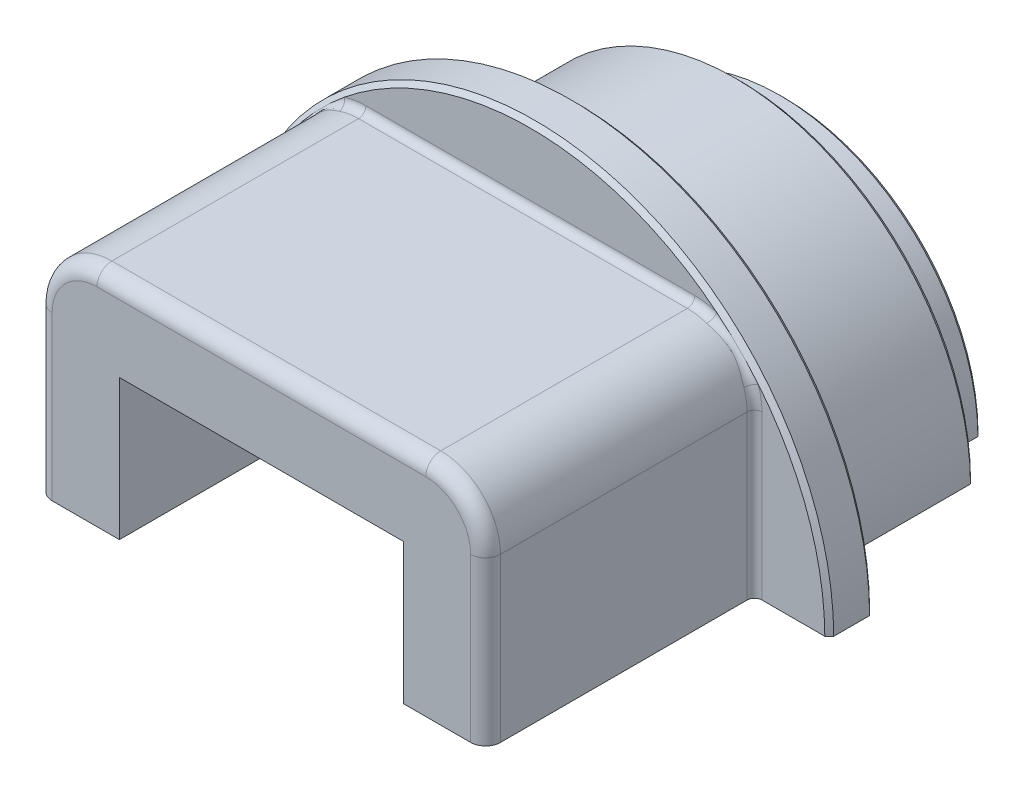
ISO-10303-21;
HEADER;
FILE_DESCRIPTION(('STEP AP214'),'2;1');
FILE_NAME('part.step','',(''),(''),'','','');
FILE_SCHEMA(('AUTOMOTIVE_DESIGN { 1 0 10303 214 1 1 1 1 }'));
ENDSEC;
DATA;
#1=APPLICATION_CONTEXT('core data for automotive mechanical design processes');
#2=APPLICATION_PROTOCOL_DEFINITION('international standard','automotive_design',2000,#1);
#3=PRODUCT_CONTEXT('',#1,'mechanical');
#4=PRODUCT('Part','Part','',(#3));
#5=PRODUCT_RELATED_PRODUCT_CATEGORY('part','',(#4));
#6=PRODUCT_DEFINITION_FORMATION('','',#4);
#7=PRODUCT_DEFINITION_CONTEXT('part definition',#1,'design');
#8=PRODUCT_DEFINITION('design','',#6,#7);
#9=PRODUCT_DEFINITION_SHAPE('','',#8);
#10=(LENGTH_UNIT() NAMED_UNIT(*) SI_UNIT(.MILLI.,.METRE.));
#11=(NAMED_UNIT(*) PLANE_ANGLE_UNIT() SI_UNIT($,.RADIAN.));
#12=(NAMED_UNIT(*) SI_UNIT($,.STERADIAN.) SOLID_ANGLE_UNIT());
#13=UNCERTAINTY_MEASURE_WITH_UNIT(LENGTH_MEASURE(1.E-05),#10,'distance_accuracy_value','');
#14=(GEOMETRIC_REPRESENTATION_CONTEXT(3) GLOBAL_UNCERTAINTY_ASSIGNED_CONTEXT((#13)) GLOBAL_UNIT_ASSIGNED_CONTEXT((#10,
#11,#12)) REPRESENTATION_CONTEXT('',''));
#15=CARTESIAN_POINT('',(0.,0.,0.));
#16=DIRECTION('',(0.,0.,1.));
#17=DIRECTION('',(1.,0.,0.));
#18=AXIS2_PLACEMENT_3D('',#15,#16,#17);
#19=CARTESIAN_POINT('',(0.,0.,33.3968392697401));
#20=DIRECTION('',(0.,0.,-1.));
#21=DIRECTION('',(-1.,0.,0.));
#22=AXIS2_PLACEMENT_3D('',#19,#20,#21);
#23=CYLINDRICAL_SURFACE('',#22,11.1004589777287);
#24=DIRECTION('',(0.,0.,1.));
#25=VECTOR('',#24,1.);
#26=CARTESIAN_POINT('',(11.1000085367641,0.1,33.3968392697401));
#27=LINE('',#26,#25);
#28=CARTESIAN_POINT('',(11.1000085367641,0.1,-14.));
#29=VERTEX_POINT('',#28);
#30=CARTESIAN_POINT('',(11.1000085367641,0.1,2.));
#31=VERTEX_POINT('',#30);
#32=EDGE_CURVE('E472',#29,#31,#27,.T.);
#33=ORIENTED_EDGE('',*,*,#32,.T.);
#34=CARTESIAN_POINT('',(0.,0.,2.));
#35=DIRECTION('',(0.,0.,1.));
#36=DIRECTION('',(-1.,0.,0.));
#37=AXIS2_PLACEMENT_3D('',#34,#35,#36);
#38=CIRCLE('',#37,11.1004589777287);
#39=CARTESIAN_POINT('',(9.5,5.74196739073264,2.));
#40=VERTEX_POINT('',#39);
#41=EDGE_CURVE('E10',#31,#40,#38,.T.);
#42=ORIENTED_EDGE('',*,*,#41,.T.);
#43=CARTESIAN_POINT('',(0.,0.,2.));
#44=DIRECTION('',(0.,0.,1.));
#45=DIRECTION('',(-1.,0.,0.));
#46=AXIS2_PLACEMENT_3D('',#43,#44,#45);
#47=CIRCLE('',#46,11.1004589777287);
#48=CARTESIAN_POINT('',(5.74196739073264,9.5,2.));
#49=VERTEX_POINT('',#48);
#50=EDGE_CURVE('E391',#40,#49,#47,.T.);
#51=ORIENTED_EDGE('',*,*,#50,.T.);
#52=CARTESIAN_POINT('',(0.,0.,2.));
#53=DIRECTION('',(0.,0.,1.));
#54=DIRECTION('',(-1.,0.,0.));
#55=AXIS2_PLACEMENT_3D('',#52,#53,#54);
#56=CIRCLE('',#55,11.1004589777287);
#57=CARTESIAN_POINT('',(-5.74196739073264,9.5,2.));
#58=VERTEX_POINT('',#57);
#59=EDGE_CURVE('E481',#49,#58,#56,.T.);
#60=ORIENTED_EDGE('',*,*,#59,.T.);
#61=CARTESIAN_POINT('',(0.,0.,2.));
#62=DIRECTION('',(0.,0.,1.));
#63=DIRECTION('',(-1.,0.,0.));
#64=AXIS2_PLACEMENT_3D('',#61,#62,#63);
#65=CIRCLE('',#64,11.1004589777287);
#66=CARTESIAN_POINT('',(-9.5,5.74196739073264,2.));
#67=VERTEX_POINT('',#66);
#68=EDGE_CURVE('E769',#58,#67,#65,.T.);
#69=ORIENTED_EDGE('',*,*,#68,.T.);
#70=CARTESIAN_POINT('',(0.,0.,2.));
#71=DIRECTION('',(0.,0.,1.));
#72=DIRECTION('',(-1.,0.,0.));
#73=AXIS2_PLACEMENT_3D('',#70,#71,#72);
#74=CIRCLE('',#73,11.1004589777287);
#75=CARTESIAN_POINT('',(-11.1000085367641,0.1,2.));
#76=VERTEX_POINT('',#75);
#77=EDGE_CURVE('E24',#67,#76,#74,.T.);
#78=ORIENTED_EDGE('',*,*,#77,.T.);
#79=DIRECTION('',(0.,0.,-1.));
#80=VECTOR('',#79,1.);
#81=CARTESIAN_POINT('',(-11.1000085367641,0.1,33.3968392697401));
#82=LINE('',#81,#80);
#83=CARTESIAN_POINT('',(-11.1000085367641,0.1,-14.));
#84=VERTEX_POINT('',#83);
#85=EDGE_CURVE('E482',#76,#84,#82,.T.);
#86=ORIENTED_EDGE('',*,*,#85,.T.);
#87=CARTESIAN_POINT('',(0.,0.,-14.));
#88=DIRECTION('',(0.,0.,-1.));
#89=DIRECTION('',(-1.,0.,0.));
#90=AXIS2_PLACEMENT_3D('',#87,#88,#89);
#91=CIRCLE('',#90,11.1004589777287);
#92=EDGE_CURVE('E468',#84,#29,#91,.T.);
#93=ORIENTED_EDGE('',*,*,#92,.T.);
#94=EDGE_LOOP('',(#33,#42,#51,#60,#69,#78,#86,#93));
#95=FACE_BOUND('',#94,.T.);
#96=ADVANCED_FACE('F15',(#95),#23,.F.);
#97=CARTESIAN_POINT('',(-9.5,9.5,2.));
#98=DIRECTION('',(0.,0.,-1.));
#99=DIRECTION('',(0.,-1.,0.));
#100=AXIS2_PLACEMENT_3D('',#97,#98,#99);
#101=PLANE('',#100);
#102=DIRECTION('',(0.,1.,0.));
#103=VECTOR('',#102,1.);
#104=CARTESIAN_POINT('',(9.5,-9.5,2.));
#105=LINE('',#104,#103);
#106=CARTESIAN_POINT('',(9.5,0.1,2.));
#107=VERTEX_POINT('',#106);
#108=EDGE_CURVE('E406',#107,#40,#105,.T.);
#109=ORIENTED_EDGE('',*,*,#108,.T.);
#110=ORIENTED_EDGE('',*,*,#41,.F.);
#111=DIRECTION('',(1.,0.,0.));
#112=VECTOR('',#111,1.);
#113=CARTESIAN_POINT('',(-20.,0.1,2.));
#114=LINE('',#113,#112);
#115=EDGE_CURVE('E477',#107,#31,#114,.T.);
#116=ORIENTED_EDGE('',*,*,#115,.F.);
#117=EDGE_LOOP('',(#109,#110,#116));
#118=FACE_BOUND('',#117,.T.);
#119=ADVANCED_FACE('F1010',(#118),#101,.T.);
#120=CARTESIAN_POINT('',(-9.5,9.5,2.));
#121=DIRECTION('',(0.,0.,-1.));
#122=DIRECTION('',(0.,-1.,0.));
#123=AXIS2_PLACEMENT_3D('',#120,#121,#122);
#124=PLANE('',#123);
#125=DIRECTION('',(0.,-1.,0.));
#126=VECTOR('',#125,1.);
#127=CARTESIAN_POINT('',(-9.5,-9.5,2.));
#128=LINE('',#127,#126);
#129=CARTESIAN_POINT('',(-9.5,0.1,2.));
#130=VERTEX_POINT('',#129);
#131=EDGE_CURVE('E405',#67,#130,#128,.T.);
#132=ORIENTED_EDGE('',*,*,#131,.T.);
#133=DIRECTION('',(1.,0.,0.));
#134=VECTOR('',#133,1.);
#135=CARTESIAN_POINT('',(-20.,0.1,2.));
#136=LINE('',#135,#134);
#137=EDGE_CURVE('E478',#76,#130,#136,.T.);
#138=ORIENTED_EDGE('',*,*,#137,.F.);
#139=ORIENTED_EDGE('',*,*,#77,.F.);
#140=EDGE_LOOP('',(#132,#138,#139));
#141=FACE_BOUND('',#140,.T.);
#142=ADVANCED_FACE('F1012',(#141),#124,.T.);
#143=CARTESIAN_POINT('',(-9.5,9.5,2.));
#144=DIRECTION('',(0.,0.,-1.));
#145=DIRECTION('',(0.,-1.,0.));
#146=AXIS2_PLACEMENT_3D('',#143,#144,#145);
#147=PLANE('',#146);
#148=DIRECTION('',(-1.,0.,0.));
#149=VECTOR('',#148,1.);
#150=CARTESIAN_POINT('',(-9.5,9.5,2.));
#151=LINE('',#150,#149);
#152=EDGE_CURVE('E871',#49,#58,#151,.T.);
#153=ORIENTED_EDGE('',*,*,#152,.T.);
#154=ORIENTED_EDGE('',*,*,#59,.F.);
#155=EDGE_LOOP('',(#153,#154));
#156=FACE_BOUND('',#155,.T.);
#157=ADVANCED_FACE('F1018',(#156),#147,.T.);
#158=CARTESIAN_POINT('',(-20.,0.1,-14.));
#159=DIRECTION('',(0.,-1.,0.));
#160=DIRECTION('',(0.,0.,-1.));
#161=AXIS2_PLACEMENT_3D('',#158,#159,#160);
#162=PLANE('',#161);
#163=ORIENTED_EDGE('',*,*,#85,.F.);
#164=ORIENTED_EDGE('',*,*,#137,.T.);
#165=DIRECTION('',(0.,0.,1.));
#166=VECTOR('',#165,1.);
#167=CARTESIAN_POINT('',(-9.5,0.1,2.));
#168=LINE('',#167,#166);
#169=CARTESIAN_POINT('',(-9.5,0.1,21.));
#170=VERTEX_POINT('',#169);
#171=EDGE_CURVE('E401',#130,#170,#168,.T.);
#172=ORIENTED_EDGE('',*,*,#171,.T.);
#173=DIRECTION('',(1.,0.,0.));
#174=VECTOR('',#173,1.);
#175=CARTESIAN_POINT('',(-20.,0.1,21.));
#176=LINE('',#175,#174);
#177=CARTESIAN_POINT('',(-14.,0.1,21.));
#178=VERTEX_POINT('',#177);
#179=EDGE_CURVE('E787',#178,#170,#176,.T.);
#180=ORIENTED_EDGE('',*,*,#179,.F.);
#181=CARTESIAN_POINT('',(-14.,0.1,20.));
#182=DIRECTION('',(0.,1.,0.));
#183=DIRECTION('',(0.,0.,-1.));
#184=AXIS2_PLACEMENT_3D('',#181,#182,#183);
#185=CIRCLE('',#184,1.);
#186=CARTESIAN_POINT('',(-15.,0.1,20.));
#187=VERTEX_POINT('',#186);
#188=EDGE_CURVE('E414',#187,#178,#185,.T.);
#189=ORIENTED_EDGE('',*,*,#188,.F.);
#190=DIRECTION('',(0.,0.,-1.));
#191=VECTOR('',#190,1.);
#192=CARTESIAN_POINT('',(-15.,0.1,21.));
#193=LINE('',#192,#191);
#194=CARTESIAN_POINT('',(-15.,0.1,3.5));
#195=VERTEX_POINT('',#194);
#196=EDGE_CURVE('E422',#187,#195,#193,.T.);
#197=ORIENTED_EDGE('',*,*,#196,.T.);
#198=CARTESIAN_POINT('',(-15.5,0.1,3.5));
#199=DIRECTION('',(0.,1.,0.));
#200=DIRECTION('',(0.,0.,-1.));
#201=AXIS2_PLACEMENT_3D('',#198,#199,#200);
#202=CIRCLE('',#201,0.5);
#203=CARTESIAN_POINT('',(-15.5,0.1,3.));
#204=VERTEX_POINT('',#203);
#205=EDGE_CURVE('E369',#195,#204,#202,.T.);
#206=ORIENTED_EDGE('',*,*,#205,.T.);
#207=DIRECTION('',(1.,0.,0.));
#208=VECTOR('',#207,1.);
#209=CARTESIAN_POINT('',(0.,0.1,3.));
#210=LINE('',#209,#208);
#211=CARTESIAN_POINT('',(-19.6997461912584,0.1,3.));
#212=VERTEX_POINT('',#211);
#213=EDGE_CURVE('E469',#212,#204,#210,.T.);
#214=ORIENTED_EDGE('',*,*,#213,.F.);
#215=CARTESIAN_POINT('',(-19.9997499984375,0.1,2.7));
#216=CARTESIAN_POINT('',(-19.8997487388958,0.1,2.80000000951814));
#217=CARTESIAN_POINT('',(-19.799747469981,0.1,2.90000000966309));
#218=CARTESIAN_POINT('',(-19.6997461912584,0.1,3.));
#219=(BOUNDED_CURVE() B_SPLINE_CURVE(3,(#215,#216,#217,#218),.UNSPECIFIED.,.F.,
.F.) B_SPLINE_CURVE_WITH_KNOTS((4,4),(0.0339424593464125,0.0343667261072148),
.UNSPECIFIED.) CURVE() GEOMETRIC_REPRESENTATION_ITEM() RATIONAL_B_SPLINE_CURVE((1.,1.,1.,1.)) REPRESENTATION_ITEM(''));
#220=CARTESIAN_POINT('',(-19.9997499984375,0.1,2.7));
#221=VERTEX_POINT('',#220);
#222=EDGE_CURVE('E316',#221,#212,#219,.T.);
#223=ORIENTED_EDGE('',*,*,#222,.F.);
#224=DIRECTION('',(0.,0.,-1.));
#225=VECTOR('',#224,1.);
#226=CARTESIAN_POINT('',(-19.9997499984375,0.1,3.));
#227=LINE('',#226,#225);
#228=CARTESIAN_POINT('',(-19.9997499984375,0.1,0.299999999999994));
#229=VERTEX_POINT('',#228);
#230=EDGE_CURVE('E308',#221,#229,#227,.T.);
#231=ORIENTED_EDGE('',*,*,#230,.T.);
#232=CARTESIAN_POINT('',(-19.6997461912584,0.1,0.));
#233=CARTESIAN_POINT('',(-19.799747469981,0.1,0.0999999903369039));
#234=CARTESIAN_POINT('',(-19.8997487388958,0.1,0.199999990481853));
#235=CARTESIAN_POINT('',(-19.9997499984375,0.1,0.299999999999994));
#236=(BOUNDED_CURVE() B_SPLINE_CURVE(3,(#232,#233,#234,#235),.UNSPECIFIED.,.F.,
.F.) B_SPLINE_CURVE_WITH_KNOTS((4,4),(0.0900316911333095,0.090456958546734),
.UNSPECIFIED.) CURVE() GEOMETRIC_REPRESENTATION_ITEM() RATIONAL_B_SPLINE_CURVE((1.,1.,1.,1.)) REPRESENTATION_ITEM(''));
#237=CARTESIAN_POINT('',(-19.6997461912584,0.1,0.));
#238=VERTEX_POINT('',#237);
#239=EDGE_CURVE('E313',#238,#229,#236,.T.);
#240=ORIENTED_EDGE('',*,*,#239,.F.);
#241=DIRECTION('',(1.,0.,0.));
#242=VECTOR('',#241,1.);
#243=CARTESIAN_POINT('',(0.,0.1,0.));
#244=LINE('',#243,#242);
#245=CARTESIAN_POINT('',(-15.7496825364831,0.1,0.));
#246=VERTEX_POINT('',#245);
#247=EDGE_CURVE('E426',#238,#246,#244,.T.);
#248=ORIENTED_EDGE('',*,*,#247,.T.);
#249=DIRECTION('',(0.,0.,-1.));
#250=VECTOR('',#249,1.);
#251=CARTESIAN_POINT('',(-15.7496825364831,0.1,-14.));
#252=LINE('',#251,#250);
#253=CARTESIAN_POINT('',(-15.7496825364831,0.1,-10.7));
#254=VERTEX_POINT('',#253);
#255=EDGE_CURVE('E473',#246,#254,#252,.T.);
#256=ORIENTED_EDGE('',*,*,#255,.T.);
#257=CARTESIAN_POINT('',(-15.4496763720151,0.1,-11.));
#258=CARTESIAN_POINT('',(-15.5496784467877,0.1,-10.9000000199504));
#259=CARTESIAN_POINT('',(-15.6496805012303,0.1,-10.8000000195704));
#260=CARTESIAN_POINT('',(-15.7496825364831,0.1,-10.7));
#261=(BOUNDED_CURVE() B_SPLINE_CURVE(3,(#257,#258,#259,#260),.UNSPECIFIED.,.F.,
.F.) B_SPLINE_CURVE_WITH_KNOTS((4,4),(0.0708853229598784,0.071312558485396),
.UNSPECIFIED.) CURVE() GEOMETRIC_REPRESENTATION_ITEM() RATIONAL_B_SPLINE_CURVE((1.,1.,1.,1.)) REPRESENTATION_ITEM(''));
#262=CARTESIAN_POINT('',(-15.4496763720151,0.1,-11.));
#263=VERTEX_POINT('',#262);
#264=EDGE_CURVE('E462',#263,#254,#261,.T.);
#265=ORIENTED_EDGE('',*,*,#264,.F.);
#266=DIRECTION('',(-1.,0.,0.));
#267=VECTOR('',#266,1.);
#268=CARTESIAN_POINT('',(0.,0.1,-11.));
#269=LINE('',#268,#267);
#270=CARTESIAN_POINT('',(-13.2496226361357,0.1,-11.));
#271=VERTEX_POINT('',#270);
#272=EDGE_CURVE('E461',#271,#263,#269,.T.);
#273=ORIENTED_EDGE('',*,*,#272,.F.);
#274=DIRECTION('',(0.,0.,1.));
#275=VECTOR('',#274,1.);
#276=CARTESIAN_POINT('',(-13.2496226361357,0.1,-11.));
#277=LINE('',#276,#275);
#278=CARTESIAN_POINT('',(-13.2496226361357,0.1,-13.7));
#279=VERTEX_POINT('',#278);
#280=EDGE_CURVE('E438',#279,#271,#277,.T.);
#281=ORIENTED_EDGE('',*,*,#280,.F.);
#282=CARTESIAN_POINT('',(-12.949613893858,0.1,-14.));
#283=CARTESIAN_POINT('',(-13.0496168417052,0.1,-13.9000000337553));
#284=CARTESIAN_POINT('',(-13.1496197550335,0.1,-13.800000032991));
#285=CARTESIAN_POINT('',(-13.2496226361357,0.1,-13.7));
#286=(BOUNDED_CURVE() B_SPLINE_CURVE(3,(#282,#283,#284,#285),.UNSPECIFIED.,.F.,
.F.) B_SPLINE_CURVE_WITH_KNOTS((4,4),(0.0594585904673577,0.0598837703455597),
.UNSPECIFIED.) CURVE() GEOMETRIC_REPRESENTATION_ITEM() RATIONAL_B_SPLINE_CURVE((1.,1.,1.,1.)) REPRESENTATION_ITEM(''));
#287=CARTESIAN_POINT('',(-12.949613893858,0.1,-14.));
#288=VERTEX_POINT('',#287);
#289=EDGE_CURVE('E356',#288,#279,#286,.T.);
#290=ORIENTED_EDGE('',*,*,#289,.F.);
#291=DIRECTION('',(1.,0.,0.));
#292=VECTOR('',#291,1.);
#293=CARTESIAN_POINT('',(-20.,0.1,-14.));
#294=LINE('',#293,#292);
#295=EDGE_CURVE('E463',#288,#84,#294,.T.);
#296=ORIENTED_EDGE('',*,*,#295,.T.);
#297=EDGE_LOOP('',(#163,#164,#172,#180,#189,#197,#206,#214,#223,#231,#240,#248,#256,#265,#273,
#281,#290,#296));
#298=FACE_BOUND('',#297,.T.);
#299=ADVANCED_FACE('F311',(#298),#162,.T.);
#300=CARTESIAN_POINT('',(-20.,0.1,-14.));
#301=DIRECTION('',(0.,-1.,0.));
#302=DIRECTION('',(0.,0.,-1.));
#303=AXIS2_PLACEMENT_3D('',#300,#301,#302);
#304=PLANE('',#303);
#305=ORIENTED_EDGE('',*,*,#32,.F.);
#306=DIRECTION('',(1.,0.,0.));
#307=VECTOR('',#306,1.);
#308=CARTESIAN_POINT('',(-20.,0.1,-14.));
#309=LINE('',#308,#307);
#310=CARTESIAN_POINT('',(12.949613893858,0.1,-14.));
#311=VERTEX_POINT('',#310);
#312=EDGE_CURVE('E467',#29,#311,#309,.T.);
#313=ORIENTED_EDGE('',*,*,#312,.T.);
#314=CARTESIAN_POINT('',(13.2496226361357,0.1,-13.7));
#315=CARTESIAN_POINT('',(13.1496197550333,0.1,-13.8000000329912));
#316=CARTESIAN_POINT('',(13.0496168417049,0.1,-13.9000000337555));
#317=CARTESIAN_POINT('',(12.949613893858,0.1,-14.));
#318=(BOUNDED_CURVE() B_SPLINE_CURVE(3,(#314,#315,#316,#317),.UNSPECIFIED.,.F.,
.F.) B_SPLINE_CURVE_WITH_KNOTS((4,4),(0.0224878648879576,0.022912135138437),
.UNSPECIFIED.) CURVE() GEOMETRIC_REPRESENTATION_ITEM() RATIONAL_B_SPLINE_CURVE((1.,1.,1.,1.)) REPRESENTATION_ITEM(''));
#319=CARTESIAN_POINT('',(13.2496226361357,0.1,-13.7));
#320=VERTEX_POINT('',#319);
#321=EDGE_CURVE('E357',#320,#311,#318,.T.);
#322=ORIENTED_EDGE('',*,*,#321,.F.);
#323=DIRECTION('',(0.,0.,-1.));
#324=VECTOR('',#323,1.);
#325=CARTESIAN_POINT('',(13.2496226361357,0.1,-11.));
#326=LINE('',#325,#324);
#327=CARTESIAN_POINT('',(13.2496226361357,0.1,-11.));
#328=VERTEX_POINT('',#327);
#329=EDGE_CURVE('E386',#328,#320,#326,.T.);
#330=ORIENTED_EDGE('',*,*,#329,.F.);
#331=DIRECTION('',(-1.,0.,0.));
#332=VECTOR('',#331,1.);
#333=CARTESIAN_POINT('',(0.,0.1,-11.));
#334=LINE('',#333,#332);
#335=CARTESIAN_POINT('',(15.4496763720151,0.1,-11.));
#336=VERTEX_POINT('',#335);
#337=EDGE_CURVE('E455',#336,#328,#334,.T.);
#338=ORIENTED_EDGE('',*,*,#337,.F.);
#339=CARTESIAN_POINT('',(15.7496825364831,0.1,-10.7));
#340=CARTESIAN_POINT('',(15.6496805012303,0.1,-10.8000000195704));
#341=CARTESIAN_POINT('',(15.5496784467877,0.1,-10.9000000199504));
#342=CARTESIAN_POINT('',(15.4496763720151,0.1,-11.));
#343=(BOUNDED_CURVE() B_SPLINE_CURVE(3,(#339,#340,#341,#342),.UNSPECIFIED.,.F.,
.F.) B_SPLINE_CURVE_WITH_KNOTS((4,4),(0.0267302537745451,0.0271545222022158),
.UNSPECIFIED.) CURVE() GEOMETRIC_REPRESENTATION_ITEM() RATIONAL_B_SPLINE_CURVE((1.,1.,1.,1.)) REPRESENTATION_ITEM(''));
#344=CARTESIAN_POINT('',(15.7496825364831,0.1,-10.7));
#345=VERTEX_POINT('',#344);
#346=EDGE_CURVE('E385',#345,#336,#343,.T.);
#347=ORIENTED_EDGE('',*,*,#346,.F.);
#348=DIRECTION('',(0.,0.,1.));
#349=VECTOR('',#348,1.);
#350=CARTESIAN_POINT('',(15.7496825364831,0.1,-14.));
#351=LINE('',#350,#349);
#352=CARTESIAN_POINT('',(15.7496825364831,0.1,0.));
#353=VERTEX_POINT('',#352);
#354=EDGE_CURVE('E776',#345,#353,#351,.T.);
#355=ORIENTED_EDGE('',*,*,#354,.T.);
#356=DIRECTION('',(1.,0.,0.));
#357=VECTOR('',#356,1.);
#358=CARTESIAN_POINT('',(0.,0.1,0.));
#359=LINE('',#358,#357);
#360=CARTESIAN_POINT('',(19.6997461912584,0.1,0.));
#361=VERTEX_POINT('',#360);
#362=EDGE_CURVE('E429',#353,#361,#359,.T.);
#363=ORIENTED_EDGE('',*,*,#362,.T.);
#364=CARTESIAN_POINT('',(19.9997499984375,0.1,0.299999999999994));
#365=CARTESIAN_POINT('',(19.8997487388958,0.1,0.199999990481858));
#366=CARTESIAN_POINT('',(19.799747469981,0.1,0.0999999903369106));
#367=CARTESIAN_POINT('',(19.6997461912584,0.1,0.));
#368=(BOUNDED_CURVE() B_SPLINE_CURVE(3,(#364,#365,#366,#367),.UNSPECIFIED.,.F.,
.F.) B_SPLINE_CURVE_WITH_KNOTS((4,4),(0.0339424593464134,0.0343667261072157),
.UNSPECIFIED.) CURVE() GEOMETRIC_REPRESENTATION_ITEM() RATIONAL_B_SPLINE_CURVE((1.,1.,1.,1.)) REPRESENTATION_ITEM(''));
#369=CARTESIAN_POINT('',(19.9997499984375,0.1,0.299999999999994));
#370=VERTEX_POINT('',#369);
#371=EDGE_CURVE('E338',#370,#361,#368,.T.);
#372=ORIENTED_EDGE('',*,*,#371,.F.);
#373=DIRECTION('',(0.,0.,1.));
#374=VECTOR('',#373,1.);
#375=CARTESIAN_POINT('',(19.9997499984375,0.1,3.));
#376=LINE('',#375,#374);
#377=CARTESIAN_POINT('',(19.9997499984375,0.1,2.7));
#378=VERTEX_POINT('',#377);
#379=EDGE_CURVE('E322',#370,#378,#376,.T.);
#380=ORIENTED_EDGE('',*,*,#379,.T.);
#381=CARTESIAN_POINT('',(19.6997461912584,0.1,3.));
#382=CARTESIAN_POINT('',(19.799747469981,0.1,2.90000000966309));
#383=CARTESIAN_POINT('',(19.8997487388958,0.1,2.80000000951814));
#384=CARTESIAN_POINT('',(19.9997499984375,0.1,2.7));
#385=(BOUNDED_CURVE() B_SPLINE_CURVE(3,(#381,#382,#383,#384),.UNSPECIFIED.,.F.,
.F.) B_SPLINE_CURVE_WITH_KNOTS((4,4),(0.0900316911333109,0.0904569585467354),
.UNSPECIFIED.) CURVE() GEOMETRIC_REPRESENTATION_ITEM() RATIONAL_B_SPLINE_CURVE((1.,1.,1.,1.)) REPRESENTATION_ITEM(''));
#386=CARTESIAN_POINT('',(19.6997461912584,0.1,3.));
#387=VERTEX_POINT('',#386);
#388=EDGE_CURVE('E323',#387,#378,#385,.T.);
#389=ORIENTED_EDGE('',*,*,#388,.F.);
#390=DIRECTION('',(1.,0.,0.));
#391=VECTOR('',#390,1.);
#392=CARTESIAN_POINT('',(0.,0.1,3.));
#393=LINE('',#392,#391);
#394=CARTESIAN_POINT('',(15.5,0.1,3.));
#395=VERTEX_POINT('',#394);
#396=EDGE_CURVE('E425',#395,#387,#393,.T.);
#397=ORIENTED_EDGE('',*,*,#396,.F.);
#398=CARTESIAN_POINT('',(15.5,0.1,3.5));
#399=DIRECTION('',(0.,1.,0.));
#400=DIRECTION('',(0.,0.,-1.));
#401=AXIS2_PLACEMENT_3D('',#398,#399,#400);
#402=CIRCLE('',#401,0.5);
#403=CARTESIAN_POINT('',(15.,0.1,3.5));
#404=VERTEX_POINT('',#403);
#405=EDGE_CURVE('E792',#395,#404,#402,.T.);
#406=ORIENTED_EDGE('',*,*,#405,.T.);
#407=DIRECTION('',(0.,0.,1.));
#408=VECTOR('',#407,1.);
#409=CARTESIAN_POINT('',(15.,0.1,21.));
#410=LINE('',#409,#408);
#411=CARTESIAN_POINT('',(15.,0.1,20.));
#412=VERTEX_POINT('',#411);
#413=EDGE_CURVE('E418',#404,#412,#410,.T.);
#414=ORIENTED_EDGE('',*,*,#413,.T.);
#415=CARTESIAN_POINT('',(14.,0.1,20.));
#416=DIRECTION('',(0.,1.,0.));
#417=DIRECTION('',(0.,0.,-1.));
#418=AXIS2_PLACEMENT_3D('',#415,#416,#417);
#419=CIRCLE('',#418,1.);
#420=CARTESIAN_POINT('',(14.,0.1,21.));
#421=VERTEX_POINT('',#420);
#422=EDGE_CURVE('E392',#421,#412,#419,.T.);
#423=ORIENTED_EDGE('',*,*,#422,.F.);
#424=DIRECTION('',(1.,0.,0.));
#425=VECTOR('',#424,1.);
#426=CARTESIAN_POINT('',(-20.,0.1,21.));
#427=LINE('',#426,#425);
#428=CARTESIAN_POINT('',(9.5,0.1,21.));
#429=VERTEX_POINT('',#428);
#430=EDGE_CURVE('E790',#429,#421,#427,.T.);
#431=ORIENTED_EDGE('',*,*,#430,.F.);
#432=DIRECTION('',(0.,0.,-1.));
#433=VECTOR('',#432,1.);
#434=CARTESIAN_POINT('',(9.5,0.1,2.));
#435=LINE('',#434,#433);
#436=EDGE_CURVE('E396',#429,#107,#435,.T.);
#437=ORIENTED_EDGE('',*,*,#436,.T.);
#438=ORIENTED_EDGE('',*,*,#115,.T.);
#439=EDGE_LOOP('',(#305,#313,#322,#330,#338,#347,#355,#363,#372,#380,#389,#397,#406,#414,#423,
#431,#437,#438));
#440=FACE_BOUND('',#439,.T.);
#441=ADVANCED_FACE('F925',(#440),#304,.T.);
#442=CARTESIAN_POINT('',(0.,0.,3.));
#443=DIRECTION('',(0.,0.,1.));
#444=DIRECTION('',(1.,0.,0.));
#445=AXIS2_PLACEMENT_3D('',#442,#443,#444);
#446=PLANE('',#445);
#447=CARTESIAN_POINT('',(0.,0.,3.));
#448=DIRECTION('',(0.,0.,1.));
#449=DIRECTION('',(1.,0.,0.));
#450=AXIS2_PLACEMENT_3D('',#447,#448,#449);
#451=CIRCLE('',#450,19.7);
#452=CARTESIAN_POINT('',(-15.2547759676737,12.4652240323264,3.));
#453=VERTEX_POINT('',#452);
#454=EDGE_CURVE('E579',#453,#212,#451,.T.);
#455=ORIENTED_EDGE('',*,*,#454,.T.);
#456=ORIENTED_EDGE('',*,*,#213,.T.);
#457=DIRECTION('',(0.,1.,0.));
#458=VECTOR('',#457,1.);
#459=CARTESIAN_POINT('',(-15.5,0.,3.));
#460=LINE('',#459,#458);
#461=CARTESIAN_POINT('',(-15.5,11.,3.));
#462=VERTEX_POINT('',#461);
#463=EDGE_CURVE('E377',#204,#462,#460,.T.);
#464=ORIENTED_EDGE('',*,*,#463,.T.);
#465=CARTESIAN_POINT('',(-11.,11.,3.));
#466=DIRECTION('',(0.,0.,-1.));
#467=DIRECTION('',(1.,0.,0.));
#468=AXIS2_PLACEMENT_3D('',#465,#466,#467);
#469=CIRCLE('',#468,4.5);
#470=EDGE_CURVE('E585',#462,#453,#469,.T.);
#471=ORIENTED_EDGE('',*,*,#470,.T.);
#472=EDGE_LOOP('',(#455,#456,#464,#471));
#473=FACE_BOUND('',#472,.T.);
#474=ADVANCED_FACE('F1029',(#473),#446,.T.);
#475=CARTESIAN_POINT('',(0.,0.,-14.));
#476=DIRECTION('',(0.,0.,1.));
#477=DIRECTION('',(1.,0.,0.));
#478=AXIS2_PLACEMENT_3D('',#475,#476,#477);
#479=CYLINDRICAL_SURFACE('',#478,15.75);
#480=ORIENTED_EDGE('',*,*,#354,.F.);
#481=CARTESIAN_POINT('',(0.,0.,-10.7));
#482=DIRECTION('',(0.,0.,1.));
#483=DIRECTION('',(-1.,0.,0.));
#484=AXIS2_PLACEMENT_3D('',#481,#482,#483);
#485=CIRCLE('',#484,15.75);
#486=EDGE_CURVE('E381',#345,#254,#485,.T.);
#487=ORIENTED_EDGE('',*,*,#486,.T.);
#488=ORIENTED_EDGE('',*,*,#255,.F.);
#489=CARTESIAN_POINT('',(0.,0.,0.));
#490=DIRECTION('',(0.,0.,-1.));
#491=DIRECTION('',(1.,0.,0.));
#492=AXIS2_PLACEMENT_3D('',#489,#490,#491);
#493=CIRCLE('',#492,15.75);
#494=EDGE_CURVE('E432',#246,#353,#493,.T.);
#495=ORIENTED_EDGE('',*,*,#494,.T.);
#496=EDGE_LOOP('',(#480,#487,#488,#495));
#497=FACE_BOUND('',#496,.T.);
#498=ADVANCED_FACE('F1032',(#497),#479,.T.);
#499=CARTESIAN_POINT('',(0.,0.,-14.));
#500=DIRECTION('',(0.,0.,-1.));
#501=DIRECTION('',(0.,-1.,0.));
#502=AXIS2_PLACEMENT_3D('',#499,#500,#501);
#503=PLANE('',#502);
#504=ORIENTED_EDGE('',*,*,#92,.F.);
#505=ORIENTED_EDGE('',*,*,#295,.F.);
#506=CARTESIAN_POINT('',(0.,0.,-14.));
#507=DIRECTION('',(0.,0.,-1.));
#508=DIRECTION('',(-1.,0.,0.));
#509=AXIS2_PLACEMENT_3D('',#506,#507,#508);
#510=CIRCLE('',#509,12.95);
#511=EDGE_CURVE('E353',#288,#311,#510,.T.);
#512=ORIENTED_EDGE('',*,*,#511,.T.);
#513=ORIENTED_EDGE('',*,*,#312,.F.);
#514=EDGE_LOOP('',(#504,#505,#512,#513));
#515=FACE_BOUND('',#514,.T.);
#516=ADVANCED_FACE('F963',(#515),#503,.T.);
#517=CARTESIAN_POINT('',(0.,0.,-11.));
#518=DIRECTION('',(0.,0.,-1.));
#519=DIRECTION('',(0.,-1.,0.));
#520=AXIS2_PLACEMENT_3D('',#517,#518,#519);
#521=PLANE('',#520);
#522=CARTESIAN_POINT('',(0.,0.,-11.));
#523=DIRECTION('',(0.,0.,-1.));
#524=DIRECTION('',(-1.,0.,0.));
#525=AXIS2_PLACEMENT_3D('',#522,#523,#524);
#526=CIRCLE('',#525,15.45);
#527=EDGE_CURVE('E454',#263,#336,#526,.T.);
#528=ORIENTED_EDGE('',*,*,#527,.T.);
#529=ORIENTED_EDGE('',*,*,#337,.T.);
#530=CARTESIAN_POINT('',(0.,0.,-11.));
#531=DIRECTION('',(0.,0.,-1.));
#532=DIRECTION('',(-1.,0.,0.));
#533=AXIS2_PLACEMENT_3D('',#530,#531,#532);
#534=CIRCLE('',#533,13.25);
#535=EDGE_CURVE('E445',#271,#328,#534,.T.);
#536=ORIENTED_EDGE('',*,*,#535,.F.);
#537=ORIENTED_EDGE('',*,*,#272,.T.);
#538=EDGE_LOOP('',(#528,#529,#536,#537));
#539=FACE_BOUND('',#538,.T.);
#540=ADVANCED_FACE('F942',(#539),#521,.T.);
#541=CARTESIAN_POINT('',(0.,0.,-11.));
#542=DIRECTION('',(0.,0.,1.));
#543=DIRECTION('',(1.,0.,0.));
#544=AXIS2_PLACEMENT_3D('',#541,#542,#543);
#545=CONICAL_SURFACE('',#544,15.45,0.785398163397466);
#546=ORIENTED_EDGE('',*,*,#486,.F.);
#547=ORIENTED_EDGE('',*,*,#346,.T.);
#548=ORIENTED_EDGE('',*,*,#527,.F.);
#549=ORIENTED_EDGE('',*,*,#264,.T.);
#550=EDGE_LOOP('',(#546,#547,#548,#549));
#551=FACE_BOUND('',#550,.T.);
#552=ADVANCED_FACE('F946',(#551),#545,.T.);
#553=CARTESIAN_POINT('',(0.,0.,-11.));
#554=DIRECTION('',(0.,0.,-1.));
#555=DIRECTION('',(-1.,0.,0.));
#556=AXIS2_PLACEMENT_3D('',#553,#554,#555);
#557=CYLINDRICAL_SURFACE('',#556,13.25);
#558=CARTESIAN_POINT('',(0.,0.,-13.7));
#559=DIRECTION('',(0.,0.,1.));
#560=DIRECTION('',(-1.,0.,0.));
#561=AXIS2_PLACEMENT_3D('',#558,#559,#560);
#562=CIRCLE('',#561,13.25);
#563=EDGE_CURVE('E351',#320,#279,#562,.T.);
#564=ORIENTED_EDGE('',*,*,#563,.T.);
#565=ORIENTED_EDGE('',*,*,#280,.T.);
#566=ORIENTED_EDGE('',*,*,#535,.T.);
#567=ORIENTED_EDGE('',*,*,#329,.T.);
#568=EDGE_LOOP('',(#564,#565,#566,#567));
#569=FACE_BOUND('',#568,.T.);
#570=ADVANCED_FACE('F955',(#569),#557,.T.);
#571=CARTESIAN_POINT('',(0.,0.,-14.));
#572=DIRECTION('',(0.,0.,1.));
#573=DIRECTION('',(1.,0.,0.));
#574=AXIS2_PLACEMENT_3D('',#571,#572,#573);
#575=CONICAL_SURFACE('',#574,12.95,0.785398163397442);
#576=ORIENTED_EDGE('',*,*,#563,.F.);
#577=ORIENTED_EDGE('',*,*,#321,.T.);
#578=ORIENTED_EDGE('',*,*,#511,.F.);
#579=ORIENTED_EDGE('',*,*,#289,.T.);
#580=EDGE_LOOP('',(#576,#577,#578,#579));
#581=FACE_BOUND('',#580,.T.);
#582=ADVANCED_FACE('F959',(#581),#575,.T.);
#583=CARTESIAN_POINT('',(0.,0.,0.));
#584=DIRECTION('',(0.,0.,1.));
#585=DIRECTION('',(1.,0.,0.));
#586=AXIS2_PLACEMENT_3D('',#583,#584,#585);
#587=PLANE('',#586);
#588=ORIENTED_EDGE('',*,*,#247,.F.);
#589=CARTESIAN_POINT('',(0.,0.,0.));
#590=DIRECTION('',(0.,0.,-1.));
#591=DIRECTION('',(1.,0.,0.));
#592=AXIS2_PLACEMENT_3D('',#589,#590,#591);
#593=CIRCLE('',#592,19.7);
#594=EDGE_CURVE('E331',#238,#361,#593,.T.);
#595=ORIENTED_EDGE('',*,*,#594,.T.);
#596=ORIENTED_EDGE('',*,*,#362,.F.);
#597=ORIENTED_EDGE('',*,*,#494,.F.);
#598=EDGE_LOOP('',(#588,#595,#596,#597));
#599=FACE_BOUND('',#598,.T.);
#600=ADVANCED_FACE('F1047',(#599),#587,.F.);
#601=CARTESIAN_POINT('',(0.,0.,3.));
#602=DIRECTION('',(0.,0.,1.));
#603=DIRECTION('',(1.,0.,0.));
#604=AXIS2_PLACEMENT_3D('',#601,#602,#603);
#605=PLANE('',#604);
#606=DIRECTION('',(0.,-1.,0.));
#607=VECTOR('',#606,1.);
#608=CARTESIAN_POINT('',(15.5,0.,3.));
#609=LINE('',#608,#607);
#610=CARTESIAN_POINT('',(15.5,11.,3.));
#611=VERTEX_POINT('',#610);
#612=EDGE_CURVE('E419',#611,#395,#609,.T.);
#613=ORIENTED_EDGE('',*,*,#612,.T.);
#614=ORIENTED_EDGE('',*,*,#396,.T.);
#615=CARTESIAN_POINT('',(0.,0.,3.));
#616=DIRECTION('',(0.,0.,1.));
#617=DIRECTION('',(1.,0.,0.));
#618=AXIS2_PLACEMENT_3D('',#615,#616,#617);
#619=CIRCLE('',#618,19.7);
#620=CARTESIAN_POINT('',(15.2547759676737,12.4652240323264,3.));
#621=VERTEX_POINT('',#620);
#622=EDGE_CURVE('E363',#387,#621,#619,.T.);
#623=ORIENTED_EDGE('',*,*,#622,.T.);
#624=CARTESIAN_POINT('',(11.,11.,3.));
#625=DIRECTION('',(0.,0.,-1.));
#626=DIRECTION('',(1.,0.,0.));
#627=AXIS2_PLACEMENT_3D('',#624,#625,#626);
#628=CIRCLE('',#627,4.5);
#629=EDGE_CURVE('E339',#621,#611,#628,.T.);
#630=ORIENTED_EDGE('',*,*,#629,.T.);
#631=EDGE_LOOP('',(#613,#614,#623,#630));
#632=FACE_BOUND('',#631,.T.);
#633=ADVANCED_FACE('F1050',(#632),#605,.T.);
#634=CARTESIAN_POINT('',(-15.,-11.,21.));
#635=DIRECTION('',(1.,0.,0.));
#636=DIRECTION('',(0.,1.,0.));
#637=AXIS2_PLACEMENT_3D('',#634,#635,#636);
#638=PLANE('',#637);
#639=ORIENTED_EDGE('',*,*,#196,.F.);
#640=DIRECTION('',(0.,1.,0.));
#641=VECTOR('',#640,1.);
#642=CARTESIAN_POINT('',(-15.,11.,20.));
#643=LINE('',#642,#641);
#644=CARTESIAN_POINT('',(-15.,11.,20.));
#645=VERTEX_POINT('',#644);
#646=EDGE_CURVE('E411',#187,#645,#643,.T.);
#647=ORIENTED_EDGE('',*,*,#646,.T.);
#648=DIRECTION('',(0.,0.,-1.));
#649=VECTOR('',#648,1.);
#650=CARTESIAN_POINT('',(-15.,11.,21.));
#651=LINE('',#650,#649);
#652=CARTESIAN_POINT('',(-15.,11.,3.5));
#653=VERTEX_POINT('',#652);
#654=EDGE_CURVE('E542',#645,#653,#651,.T.);
#655=ORIENTED_EDGE('',*,*,#654,.T.);
#656=DIRECTION('',(0.,-1.,0.));
#657=VECTOR('',#656,1.);
#658=CARTESIAN_POINT('',(-15.,-11.,3.5));
#659=LINE('',#658,#657);
#660=EDGE_CURVE('E373',#653,#195,#659,.T.);
#661=ORIENTED_EDGE('',*,*,#660,.T.);
#662=EDGE_LOOP('',(#639,#647,#655,#661));
#663=FACE_BOUND('',#662,.T.);
#664=ADVANCED_FACE('F1054',(#663),#638,.F.);
#665=CARTESIAN_POINT('',(15.,-11.,21.));
#666=DIRECTION('',(-1.,0.,0.));
#667=DIRECTION('',(0.,0.,1.));
#668=AXIS2_PLACEMENT_3D('',#665,#666,#667);
#669=PLANE('',#668);
#670=ORIENTED_EDGE('',*,*,#413,.F.);
#671=DIRECTION('',(0.,1.,0.));
#672=VECTOR('',#671,1.);
#673=CARTESIAN_POINT('',(15.,-11.,3.5));
#674=LINE('',#673,#672);
#675=CARTESIAN_POINT('',(15.,11.,3.5));
#676=VERTEX_POINT('',#675);
#677=EDGE_CURVE('E415',#404,#676,#674,.T.);
#678=ORIENTED_EDGE('',*,*,#677,.T.);
#679=DIRECTION('',(0.,0.,-1.));
#680=VECTOR('',#679,1.);
#681=CARTESIAN_POINT('',(15.,11.,21.));
#682=LINE('',#681,#680);
#683=CARTESIAN_POINT('',(15.,11.,20.));
#684=VERTEX_POINT('',#683);
#685=EDGE_CURVE('E651',#684,#676,#682,.T.);
#686=ORIENTED_EDGE('',*,*,#685,.F.);
#687=DIRECTION('',(0.,-1.,0.));
#688=VECTOR('',#687,1.);
#689=CARTESIAN_POINT('',(15.,-11.,20.));
#690=LINE('',#689,#688);
#691=EDGE_CURVE('E387',#684,#412,#690,.T.);
#692=ORIENTED_EDGE('',*,*,#691,.T.);
#693=EDGE_LOOP('',(#670,#678,#686,#692));
#694=FACE_BOUND('',#693,.T.);
#695=ADVANCED_FACE('F680',(#694),#669,.F.);
#696=CARTESIAN_POINT('',(15.5,-11.,3.5));
#697=DIRECTION('',(0.,1.,0.));
#698=DIRECTION('',(0.,0.,1.));
#699=AXIS2_PLACEMENT_3D('',#696,#697,#698);
#700=CYLINDRICAL_SURFACE('',#699,0.5);
#701=ORIENTED_EDGE('',*,*,#405,.F.);
#702=ORIENTED_EDGE('',*,*,#612,.F.);
#703=CARTESIAN_POINT('',(15.5,11.,3.5));
#704=DIRECTION('',(0.,1.,0.));
#705=DIRECTION('',(0.,0.,1.));
#706=AXIS2_PLACEMENT_3D('',#703,#704,#705);
#707=CIRCLE('',#706,0.5);
#708=EDGE_CURVE('E347',#611,#676,#707,.T.);
#709=ORIENTED_EDGE('',*,*,#708,.T.);
#710=ORIENTED_EDGE('',*,*,#677,.F.);
#711=EDGE_LOOP('',(#701,#702,#709,#710));
#712=FACE_BOUND('',#711,.T.);
#713=ADVANCED_FACE('F676',(#712),#700,.F.);
#714=CARTESIAN_POINT('',(-11.,11.,21.));
#715=DIRECTION('',(0.,0.,1.));
#716=DIRECTION('',(1.,0.,0.));
#717=AXIS2_PLACEMENT_3D('',#714,#715,#716);
#718=PLANE('',#717);
#719=DIRECTION('',(0.,-1.,0.));
#720=VECTOR('',#719,1.);
#721=CARTESIAN_POINT('',(-14.,-11.,21.));
#722=LINE('',#721,#720);
#723=CARTESIAN_POINT('',(-14.,11.,21.));
#724=VERTEX_POINT('',#723);
#725=EDGE_CURVE('E791',#724,#178,#722,.T.);
#726=ORIENTED_EDGE('',*,*,#725,.T.);
#727=ORIENTED_EDGE('',*,*,#179,.T.);
#728=DIRECTION('',(0.,-1.,0.));
#729=VECTOR('',#728,1.);
#730=CARTESIAN_POINT('',(-9.5,-9.5,21.));
#731=LINE('',#730,#729);
#732=CARTESIAN_POINT('',(-9.5,9.5,21.));
#733=VERTEX_POINT('',#732);
#734=EDGE_CURVE('E407',#733,#170,#731,.T.);
#735=ORIENTED_EDGE('',*,*,#734,.F.);
#736=DIRECTION('',(-1.,0.,0.));
#737=VECTOR('',#736,1.);
#738=CARTESIAN_POINT('',(-9.5,9.5,21.));
#739=LINE('',#738,#737);
#740=CARTESIAN_POINT('',(9.5,9.5,21.));
#741=VERTEX_POINT('',#740);
#742=EDGE_CURVE('E860',#741,#733,#739,.T.);
#743=ORIENTED_EDGE('',*,*,#742,.F.);
#744=DIRECTION('',(0.,1.,0.));
#745=VECTOR('',#744,1.);
#746=CARTESIAN_POINT('',(9.5,-9.5,21.));
#747=LINE('',#746,#745);
#748=EDGE_CURVE('E400',#429,#741,#747,.T.);
#749=ORIENTED_EDGE('',*,*,#748,.F.);
#750=ORIENTED_EDGE('',*,*,#430,.T.);
#751=DIRECTION('',(0.,1.,0.));
#752=VECTOR('',#751,1.);
#753=CARTESIAN_POINT('',(14.,11.,21.));
#754=LINE('',#753,#752);
#755=CARTESIAN_POINT('',(14.,11.,21.));
#756=VERTEX_POINT('',#755);
#757=EDGE_CURVE('E380',#421,#756,#754,.T.);
#758=ORIENTED_EDGE('',*,*,#757,.T.);
#759=CARTESIAN_POINT('',(11.,11.,21.));
#760=DIRECTION('',(0.,0.,1.));
#761=DIRECTION('',(1.,0.,0.));
#762=AXIS2_PLACEMENT_3D('',#759,#760,#761);
#763=CIRCLE('',#762,3.);
#764=CARTESIAN_POINT('',(11.,14.,21.));
#765=VERTEX_POINT('',#764);
#766=EDGE_CURVE('E888',#756,#765,#763,.T.);
#767=ORIENTED_EDGE('',*,*,#766,.T.);
#768=DIRECTION('',(-1.,0.,0.));
#769=VECTOR('',#768,1.);
#770=CARTESIAN_POINT('',(-11.,14.,21.));
#771=LINE('',#770,#769);
#772=CARTESIAN_POINT('',(-11.,14.,21.));
#773=VERTEX_POINT('',#772);
#774=EDGE_CURVE('E856',#765,#773,#771,.T.);
#775=ORIENTED_EDGE('',*,*,#774,.T.);
#776=CARTESIAN_POINT('',(-11.,11.,21.));
#777=DIRECTION('',(0.,0.,1.));
#778=DIRECTION('',(1.,0.,0.));
#779=AXIS2_PLACEMENT_3D('',#776,#777,#778);
#780=CIRCLE('',#779,3.);
#781=EDGE_CURVE('E900',#773,#724,#780,.T.);
#782=ORIENTED_EDGE('',*,*,#781,.T.);
#783=EDGE_LOOP('',(#726,#727,#735,#743,#749,#750,#758,#767,#775,#782));
#784=FACE_BOUND('',#783,.T.);
#785=ADVANCED_FACE('F679',(#784),#718,.T.);
#786=CARTESIAN_POINT('',(-14.,11.,20.));
#787=DIRECTION('',(0.,1.,0.));
#788=DIRECTION('',(0.,0.,1.));
#789=AXIS2_PLACEMENT_3D('',#786,#787,#788);
#790=CYLINDRICAL_SURFACE('',#789,1.);
#791=ORIENTED_EDGE('',*,*,#646,.F.);
#792=ORIENTED_EDGE('',*,*,#188,.T.);
#793=ORIENTED_EDGE('',*,*,#725,.F.);
#794=CARTESIAN_POINT('',(-14.,11.,20.));
#795=DIRECTION('',(0.,1.,0.));
#796=DIRECTION('',(0.,0.,1.));
#797=AXIS2_PLACEMENT_3D('',#794,#795,#796);
#798=CIRCLE('',#797,1.);
#799=EDGE_CURVE('E891',#645,#724,#798,.T.);
#800=ORIENTED_EDGE('',*,*,#799,.F.);
#801=EDGE_LOOP('',(#791,#792,#793,#800));
#802=FACE_BOUND('',#801,.T.);
#803=ADVANCED_FACE('F993',(#802),#790,.T.);
#804=CARTESIAN_POINT('',(-9.5,-9.5,2.));
#805=DIRECTION('',(-1.,0.,0.));
#806=DIRECTION('',(0.,0.,1.));
#807=AXIS2_PLACEMENT_3D('',#804,#805,#806);
#808=PLANE('',#807);
#809=ORIENTED_EDGE('',*,*,#171,.F.);
#810=ORIENTED_EDGE('',*,*,#131,.F.);
#811=DIRECTION('',(0.,-1.,0.));
#812=VECTOR('',#811,1.);
#813=CARTESIAN_POINT('',(-9.5,-9.5,2.));
#814=LINE('',#813,#812);
#815=CARTESIAN_POINT('',(-9.5,9.5,2.));
#816=VERTEX_POINT('',#815);
#817=EDGE_CURVE('E973',#816,#67,#814,.T.);
#818=ORIENTED_EDGE('',*,*,#817,.F.);
#819=DIRECTION('',(0.,0.,1.));
#820=VECTOR('',#819,1.);
#821=CARTESIAN_POINT('',(-9.5,9.5,2.));
#822=LINE('',#821,#820);
#823=EDGE_CURVE('E867',#816,#733,#822,.T.);
#824=ORIENTED_EDGE('',*,*,#823,.T.);
#825=ORIENTED_EDGE('',*,*,#734,.T.);
#826=EDGE_LOOP('',(#809,#810,#818,#824,#825));
#827=FACE_BOUND('',#826,.T.);
#828=ADVANCED_FACE('F997',(#827),#808,.F.);
#829=CARTESIAN_POINT('',(9.5,-9.5,2.));
#830=DIRECTION('',(1.,0.,0.));
#831=DIRECTION('',(0.,1.,0.));
#832=AXIS2_PLACEMENT_3D('',#829,#830,#831);
#833=PLANE('',#832);
#834=ORIENTED_EDGE('',*,*,#436,.F.);
#835=ORIENTED_EDGE('',*,*,#748,.T.);
#836=DIRECTION('',(0.,0.,1.));
#837=VECTOR('',#836,1.);
#838=CARTESIAN_POINT('',(9.5,9.5,2.));
#839=LINE('',#838,#837);
#840=CARTESIAN_POINT('',(9.5,9.5,2.));
#841=VERTEX_POINT('',#840);
#842=EDGE_CURVE('E708',#841,#741,#839,.T.);
#843=ORIENTED_EDGE('',*,*,#842,.F.);
#844=DIRECTION('',(0.,1.,0.));
#845=VECTOR('',#844,1.);
#846=CARTESIAN_POINT('',(9.5,-9.5,2.));
#847=LINE('',#846,#845);
#848=EDGE_CURVE('E393',#40,#841,#847,.T.);
#849=ORIENTED_EDGE('',*,*,#848,.F.);
#850=ORIENTED_EDGE('',*,*,#108,.F.);
#851=EDGE_LOOP('',(#834,#835,#843,#849,#850));
#852=FACE_BOUND('',#851,.T.);
#853=ADVANCED_FACE('F1008',(#852),#833,.F.);
#854=CARTESIAN_POINT('',(-9.5,9.5,2.));
#855=DIRECTION('',(0.,0.,-1.));
#856=DIRECTION('',(0.,-1.,0.));
#857=AXIS2_PLACEMENT_3D('',#854,#855,#856);
#858=PLANE('',#857);
#859=DIRECTION('',(-1.,0.,0.));
#860=VECTOR('',#859,1.);
#861=CARTESIAN_POINT('',(-9.5,9.5,2.));
#862=LINE('',#861,#860);
#863=EDGE_CURVE('E875',#841,#49,#862,.T.);
#864=ORIENTED_EDGE('',*,*,#863,.T.);
#865=ORIENTED_EDGE('',*,*,#50,.F.);
#866=ORIENTED_EDGE('',*,*,#848,.T.);
#867=EDGE_LOOP('',(#864,#865,#866));
#868=FACE_BOUND('',#867,.T.);
#869=ADVANCED_FACE('F1069',(#868),#858,.F.);
#870=CARTESIAN_POINT('',(14.,11.,20.));
#871=DIRECTION('',(0.,-1.,0.));
#872=DIRECTION('',(0.,0.,-1.));
#873=AXIS2_PLACEMENT_3D('',#870,#871,#872);
#874=CYLINDRICAL_SURFACE('',#873,1.);
#875=ORIENTED_EDGE('',*,*,#757,.F.);
#876=ORIENTED_EDGE('',*,*,#422,.T.);
#877=ORIENTED_EDGE('',*,*,#691,.F.);
#878=CARTESIAN_POINT('',(14.,11.,20.));
#879=DIRECTION('',(0.,1.,0.));
#880=DIRECTION('',(0.,0.,1.));
#881=AXIS2_PLACEMENT_3D('',#878,#879,#880);
#882=CIRCLE('',#881,1.);
#883=EDGE_CURVE('E884',#756,#684,#882,.T.);
#884=ORIENTED_EDGE('',*,*,#883,.F.);
#885=EDGE_LOOP('',(#875,#876,#877,#884));
#886=FACE_BOUND('',#885,.T.);
#887=ADVANCED_FACE('F1070',(#886),#874,.T.);
#888=CARTESIAN_POINT('',(-15.5,-11.,3.5));
#889=DIRECTION('',(0.,-1.,0.));
#890=DIRECTION('',(0.,0.,-1.));
#891=AXIS2_PLACEMENT_3D('',#888,#889,#890);
#892=CYLINDRICAL_SURFACE('',#891,0.5);
#893=ORIENTED_EDGE('',*,*,#205,.F.);
#894=ORIENTED_EDGE('',*,*,#660,.F.);
#895=CARTESIAN_POINT('',(-15.5,11.,3.5));
#896=DIRECTION('',(0.,-1.,0.));
#897=DIRECTION('',(0.,0.,-1.));
#898=AXIS2_PLACEMENT_3D('',#895,#896,#897);
#899=CIRCLE('',#898,0.5);
#900=EDGE_CURVE('E589',#462,#653,#899,.T.);
#901=ORIENTED_EDGE('',*,*,#900,.F.);
#902=ORIENTED_EDGE('',*,*,#463,.F.);
#903=EDGE_LOOP('',(#893,#894,#901,#902));
#904=FACE_BOUND('',#903,.T.);
#905=ADVANCED_FACE('F1073',(#904),#892,.F.);
#906=CARTESIAN_POINT('',(0.,0.,3.));
#907=DIRECTION('',(0.,0.,-1.));
#908=DIRECTION('',(-1.,0.,0.));
#909=AXIS2_PLACEMENT_3D('',#906,#907,#908);
#910=CYLINDRICAL_SURFACE('',#909,20.);
#911=ORIENTED_EDGE('',*,*,#230,.F.);
#912=CARTESIAN_POINT('',(0.,0.,2.7));
#913=DIRECTION('',(0.,0.,-1.));
#914=DIRECTION('',(1.,0.,0.));
#915=AXIS2_PLACEMENT_3D('',#912,#913,#914);
#916=CIRCLE('',#915,20.);
#917=EDGE_CURVE('E333',#221,#378,#916,.T.);
#918=ORIENTED_EDGE('',*,*,#917,.T.);
#919=ORIENTED_EDGE('',*,*,#379,.F.);
#920=CARTESIAN_POINT('',(0.,0.,0.299999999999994));
#921=DIRECTION('',(0.,0.,1.));
#922=DIRECTION('',(1.,0.,0.));
#923=AXIS2_PLACEMENT_3D('',#920,#921,#922);
#924=CIRCLE('',#923,20.);
#925=EDGE_CURVE('E329',#370,#229,#924,.T.);
#926=ORIENTED_EDGE('',*,*,#925,.T.);
#927=EDGE_LOOP('',(#911,#918,#919,#926));
#928=FACE_BOUND('',#927,.T.);
#929=ADVANCED_FACE('F335',(#928),#910,.T.);
#930=CARTESIAN_POINT('',(0.,0.,3.));
#931=DIRECTION('',(0.,0.,-1.));
#932=DIRECTION('',(-1.,0.,0.));
#933=AXIS2_PLACEMENT_3D('',#930,#931,#932);
#934=CONICAL_SURFACE('',#933,19.7,0.785398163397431);
#935=ORIENTED_EDGE('',*,*,#917,.F.);
#936=ORIENTED_EDGE('',*,*,#222,.T.);
#937=ORIENTED_EDGE('',*,*,#454,.F.);
#938=CARTESIAN_POINT('',(-12.4652240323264,15.2547759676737,3.));
#939=CARTESIAN_POINT('',(-12.5892916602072,15.1533958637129,3.));
#940=CARTESIAN_POINT('',(-12.7128061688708,15.0499516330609,2.99999999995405));
#941=CARTESIAN_POINT('',(-12.9597093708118,14.8378710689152,3.00000000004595));
#942=CARTESIAN_POINT('',(-13.0836686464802,14.7287080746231,2.99999999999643));
#943=CARTESIAN_POINT('',(-13.4509882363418,14.3968685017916,3.00000000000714));
#944=CARTESIAN_POINT('',(-13.6906734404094,14.1693256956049,2.99999999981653));
#945=CARTESIAN_POINT('',(-14.1688653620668,13.6911498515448,3.00000000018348));
#946=CARTESIAN_POINT('',(-14.3966251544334,13.4512457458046,3.0000000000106));
#947=CARTESIAN_POINT('',(-14.7283528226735,13.0840677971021,2.9999999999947));
#948=CARTESIAN_POINT('',(-14.837553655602,12.9600741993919,3.00000000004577));
#949=CARTESIAN_POINT('',(-15.049786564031,12.7130030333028,2.99999999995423));
#950=CARTESIAN_POINT('',(-15.1533096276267,12.589397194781,3.));
#951=CARTESIAN_POINT('',(-15.2547759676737,12.4652240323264,3.));
#952=(BOUNDED_CURVE() B_SPLINE_CURVE(3,(#938,#939,#940,#941,#942,#943,#944,#945,#946,#947,#948,
#949,#950,#951),.UNSPECIFIED.,.F.,.F.) B_SPLINE_CURVE_WITH_KNOTS((4,2,2,2,2,2,4),
(0.00135809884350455,0.00187654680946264,0.00239499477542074,0.00343189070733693,
0.00446878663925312,0.00498723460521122,0.00550568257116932),
.UNSPECIFIED.) CURVE() GEOMETRIC_REPRESENTATION_ITEM() RATIONAL_B_SPLINE_CURVE((1.,1.,1.,1.,1.,
1.,1.,1.,1.,1.,1.,1.,1.,1.)) REPRESENTATION_ITEM(''));
#953=CARTESIAN_POINT('',(-12.4652240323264,15.2547759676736,3.));
#954=VERTEX_POINT('',#953);
#955=EDGE_CURVE('E491',#954,#453,#952,.T.);
#956=ORIENTED_EDGE('',*,*,#955,.F.);
#957=CARTESIAN_POINT('',(0.,0.,3.));
#958=DIRECTION('',(0.,0.,1.));
#959=DIRECTION('',(1.,0.,0.));
#960=AXIS2_PLACEMENT_3D('',#957,#958,#959);
#961=CIRCLE('',#960,19.7);
#962=CARTESIAN_POINT('',(12.4652240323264,15.2547759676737,3.));
#963=VERTEX_POINT('',#962);
#964=EDGE_CURVE('E595',#963,#954,#961,.T.);
#965=ORIENTED_EDGE('',*,*,#964,.F.);
#966=CARTESIAN_POINT('',(15.2547759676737,12.4652240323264,3.));
#967=CARTESIAN_POINT('',(15.1533958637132,12.5892916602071,3.));
#968=CARTESIAN_POINT('',(15.0499516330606,12.7128061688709,2.9999999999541));
#969=CARTESIAN_POINT('',(14.8378710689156,12.9597093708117,3.0000000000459));
#970=CARTESIAN_POINT('',(14.7287080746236,13.0836686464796,2.99999999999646));
#971=CARTESIAN_POINT('',(14.3968685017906,13.450988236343,3.00000000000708));
#972=CARTESIAN_POINT('',(14.1693256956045,13.6906734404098,2.99999999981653));
#973=CARTESIAN_POINT('',(13.6911498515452,14.1688653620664,3.00000000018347));
#974=CARTESIAN_POINT('',(13.4512457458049,14.3966251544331,3.00000000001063));
#975=CARTESIAN_POINT('',(13.084067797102,14.7283528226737,2.99999999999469));
#976=CARTESIAN_POINT('',(12.9600741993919,14.8375536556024,3.00000000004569));
#977=CARTESIAN_POINT('',(12.7130030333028,15.0497865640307,2.99999999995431));
#978=CARTESIAN_POINT('',(12.5893971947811,15.1533096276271,3.));
#979=CARTESIAN_POINT('',(12.4652240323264,15.2547759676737,3.));
#980=(BOUNDED_CURVE() B_SPLINE_CURVE(3,(#966,#967,#968,#969,#970,#971,#972,#973,#974,#975,#976,
#977,#978,#979),.UNSPECIFIED.,.F.,.F.) B_SPLINE_CURVE_WITH_KNOTS((4,2,2,2,2,2,4),
(0.00135809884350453,0.00187654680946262,0.00239499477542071,0.00343189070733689,
0.00446878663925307,0.00498723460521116,0.00550568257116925),
.UNSPECIFIED.) CURVE() GEOMETRIC_REPRESENTATION_ITEM() RATIONAL_B_SPLINE_CURVE((1.,1.,1.,1.,1.,
1.,1.,1.,1.,1.,1.,1.,1.,1.)) REPRESENTATION_ITEM(''));
#981=EDGE_CURVE('E604',#621,#963,#980,.T.);
#982=ORIENTED_EDGE('',*,*,#981,.F.);
#983=ORIENTED_EDGE('',*,*,#622,.F.);
#984=ORIENTED_EDGE('',*,*,#388,.T.);
#985=EDGE_LOOP('',(#935,#936,#937,#956,#965,#982,#983,#984));
#986=FACE_BOUND('',#985,.T.);
#987=ADVANCED_FACE('F682',(#986),#934,.T.);
#988=CARTESIAN_POINT('',(0.,0.,0.299999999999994));
#989=DIRECTION('',(0.,0.,1.));
#990=DIRECTION('',(1.,0.,0.));
#991=AXIS2_PLACEMENT_3D('',#988,#989,#990);
#992=CONICAL_SURFACE('',#991,20.,0.785398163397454);
#993=ORIENTED_EDGE('',*,*,#925,.F.);
#994=ORIENTED_EDGE('',*,*,#371,.T.);
#995=ORIENTED_EDGE('',*,*,#594,.F.);
#996=ORIENTED_EDGE('',*,*,#239,.T.);
#997=EDGE_LOOP('',(#993,#994,#995,#996));
#998=FACE_BOUND('',#997,.T.);
#999=ADVANCED_FACE('F327',(#998),#992,.T.);
#1000=CARTESIAN_POINT('',(11.,11.,3.5));
#1001=DIRECTION('',(0.,0.,1.));
#1002=DIRECTION('',(1.,0.,0.));
#1003=AXIS2_PLACEMENT_3D('',#1000,#1001,#1002);
#1004=TOROIDAL_SURFACE('',#1003,4.5,0.5);
#1005=CARTESIAN_POINT('',(15.2547759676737,12.4652240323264,3.5));
#1006=DIRECTION('',(-0.325605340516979,0.945505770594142,0.));
#1007=DIRECTION('',(0.945505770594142,0.325605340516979,0.));
#1008=AXIS2_PLACEMENT_3D('',#1005,#1006,#1007);
#1009=CIRCLE('',#1008,0.5);
#1010=CARTESIAN_POINT('',(14.7820230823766,12.3024213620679,3.5));
#1011=VERTEX_POINT('',#1010);
#1012=EDGE_CURVE('E705',#621,#1011,#1009,.T.);
#1013=ORIENTED_EDGE('',*,*,#1012,.T.);
#1014=CARTESIAN_POINT('',(11.,11.,3.5));
#1015=DIRECTION('',(0.,0.,1.));
#1016=DIRECTION('',(1.,0.,0.));
#1017=AXIS2_PLACEMENT_3D('',#1014,#1015,#1016);
#1018=CIRCLE('',#1017,4.);
#1019=EDGE_CURVE('E641',#676,#1011,#1018,.T.);
#1020=ORIENTED_EDGE('',*,*,#1019,.F.);
#1021=ORIENTED_EDGE('',*,*,#708,.F.);
#1022=ORIENTED_EDGE('',*,*,#629,.F.);
#1023=EDGE_LOOP('',(#1013,#1020,#1021,#1022));
#1024=FACE_BOUND('',#1023,.T.);
#1025=ADVANCED_FACE('F919',(#1024),#1004,.F.);
#1026=CARTESIAN_POINT('',(-11.,11.,3.5));
#1027=DIRECTION('',(0.,0.,1.));
#1028=DIRECTION('',(1.,0.,0.));
#1029=AXIS2_PLACEMENT_3D('',#1026,#1027,#1028);
#1030=TOROIDAL_SURFACE('',#1029,4.5,0.5);
#1031=ORIENTED_EDGE('',*,*,#900,.T.);
#1032=CARTESIAN_POINT('',(-11.,11.,3.5));
#1033=DIRECTION('',(0.,0.,1.));
#1034=DIRECTION('',(1.,0.,0.));
#1035=AXIS2_PLACEMENT_3D('',#1032,#1033,#1034);
#1036=CIRCLE('',#1035,4.);
#1037=CARTESIAN_POINT('',(-14.7820230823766,12.3024213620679,3.5));
#1038=VERTEX_POINT('',#1037);
#1039=EDGE_CURVE('E539',#1038,#653,#1036,.T.);
#1040=ORIENTED_EDGE('',*,*,#1039,.F.);
#1041=CARTESIAN_POINT('',(-15.2547759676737,12.4652240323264,3.5));
#1042=DIRECTION('',(-0.325605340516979,-0.945505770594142,0.));
#1043=DIRECTION('',(0.945505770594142,-0.325605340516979,0.));
#1044=AXIS2_PLACEMENT_3D('',#1041,#1042,#1043);
#1045=CIRCLE('',#1044,0.5);
#1046=EDGE_CURVE('E592',#453,#1038,#1045,.T.);
#1047=ORIENTED_EDGE('',*,*,#1046,.F.);
#1048=ORIENTED_EDGE('',*,*,#470,.F.);
#1049=EDGE_LOOP('',(#1031,#1040,#1047,#1048));
#1050=FACE_BOUND('',#1049,.T.);
#1051=ADVANCED_FACE('F626',(#1050),#1030,.F.);
#1052=CARTESIAN_POINT('',(-11.,11.,20.));
#1053=DIRECTION('',(0.,0.,1.));
#1054=DIRECTION('',(1.,0.,0.));
#1055=AXIS2_PLACEMENT_3D('',#1052,#1053,#1054);
#1056=TOROIDAL_SURFACE('',#1055,3.,1.);
#1057=CARTESIAN_POINT('',(-11.,14.,20.));
#1058=DIRECTION('',(-1.,0.,0.));
#1059=DIRECTION('',(0.,0.,1.));
#1060=AXIS2_PLACEMENT_3D('',#1057,#1058,#1059);
#1061=CIRCLE('',#1060,1.);
#1062=CARTESIAN_POINT('',(-11.,15.,20.));
#1063=VERTEX_POINT('',#1062);
#1064=EDGE_CURVE('E845',#773,#1063,#1061,.T.);
#1065=ORIENTED_EDGE('',*,*,#1064,.T.);
#1066=CARTESIAN_POINT('',(-11.,11.,20.));
#1067=DIRECTION('',(0.,0.,-1.));
#1068=DIRECTION('',(1.,0.,0.));
#1069=AXIS2_PLACEMENT_3D('',#1066,#1067,#1068);
#1070=CIRCLE('',#1069,4.);
#1071=EDGE_CURVE('E552',#645,#1063,#1070,.T.);
#1072=ORIENTED_EDGE('',*,*,#1071,.F.);
#1073=ORIENTED_EDGE('',*,*,#799,.T.);
#1074=ORIENTED_EDGE('',*,*,#781,.F.);
#1075=EDGE_LOOP('',(#1065,#1072,#1073,#1074));
#1076=FACE_BOUND('',#1075,.T.);
#1077=ADVANCED_FACE('F624',(#1076),#1056,.T.);
#1078=CARTESIAN_POINT('',(11.,11.,20.));
#1079=DIRECTION('',(0.,0.,1.));
#1080=DIRECTION('',(1.,0.,0.));
#1081=AXIS2_PLACEMENT_3D('',#1078,#1079,#1080);
#1082=TOROIDAL_SURFACE('',#1081,3.,1.);
#1083=ORIENTED_EDGE('',*,*,#883,.T.);
#1084=CARTESIAN_POINT('',(11.,11.,20.));
#1085=DIRECTION('',(0.,0.,-1.));
#1086=DIRECTION('',(1.,0.,0.));
#1087=AXIS2_PLACEMENT_3D('',#1084,#1085,#1086);
#1088=CIRCLE('',#1087,4.);
#1089=CARTESIAN_POINT('',(11.,15.,20.));
#1090=VERTEX_POINT('',#1089);
#1091=EDGE_CURVE('E735',#1090,#684,#1088,.T.);
#1092=ORIENTED_EDGE('',*,*,#1091,.F.);
#1093=CARTESIAN_POINT('',(11.,14.,20.));
#1094=DIRECTION('',(-1.,0.,0.));
#1095=DIRECTION('',(0.,0.,1.));
#1096=AXIS2_PLACEMENT_3D('',#1093,#1094,#1095);
#1097=CIRCLE('',#1096,1.);
#1098=EDGE_CURVE('E839',#765,#1090,#1097,.T.);
#1099=ORIENTED_EDGE('',*,*,#1098,.F.);
#1100=ORIENTED_EDGE('',*,*,#766,.F.);
#1101=EDGE_LOOP('',(#1083,#1092,#1099,#1100));
#1102=FACE_BOUND('',#1101,.T.);
#1103=ADVANCED_FACE('F511',(#1102),#1082,.T.);
#1104=CARTESIAN_POINT('',(-12.3024213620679,14.7820230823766,3.5));
#1105=CARTESIAN_POINT('',(-12.3024213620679,14.7820230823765,3.));
#1106=CARTESIAN_POINT('',(-12.4652240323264,15.2547759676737,3.));
#1107=CARTESIAN_POINT('',(-12.4459476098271,14.7325967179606,3.49999997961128));
#1108=CARTESIAN_POINT('',(-12.4202880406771,14.7414331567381,3.05263715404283));
#1109=CARTESIAN_POINT('',(-12.5892916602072,15.1533958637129,3.));
#1110=CARTESIAN_POINT('',(-12.5857530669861,14.6753510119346,3.48982500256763));
#1111=CARTESIAN_POINT('',(-12.5554563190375,14.6884499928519,3.08731851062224));
#1112=CARTESIAN_POINT('',(-12.7128061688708,15.0499516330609,2.99999999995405));
#1113=CARTESIAN_POINT('',(-12.8584327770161,14.5452849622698,3.46081058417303));
#1114=CARTESIAN_POINT('',(-12.8232765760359,14.5633177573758,3.13032382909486));
#1115=CARTESIAN_POINT('',(-12.9597093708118,14.8378710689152,3.00000000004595));
#1116=CARTESIAN_POINT('',(-12.9918931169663,14.4720542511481,3.44167152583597));
#1117=CARTESIAN_POINT('',(-12.9601705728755,14.4904880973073,3.14085040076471));
#1118=CARTESIAN_POINT('',(-13.0836686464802,14.7287080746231,2.99999999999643));
#1119=CARTESIAN_POINT('',(-13.3760229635,14.2319824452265,3.38535369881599));
#1120=CARTESIAN_POINT('',(-13.3459968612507,14.2533705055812,3.1546458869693));
#1121=CARTESIAN_POINT('',(-13.4509882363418,14.3968685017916,3.00000000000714));
#1122=CARTESIAN_POINT('',(-13.6118284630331,14.044993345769,3.35075564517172));
#1123=CARTESIAN_POINT('',(-13.6030863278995,14.0537328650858,3.14595347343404));
#1124=CARTESIAN_POINT('',(-13.6906734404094,14.1693256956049,2.99999999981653));
#1125=CARTESIAN_POINT('',(-14.0446019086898,13.6122847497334,3.35071499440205));
#1126=CARTESIAN_POINT('',(-14.0533213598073,13.6035679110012,3.14594671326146));
#1127=CARTESIAN_POINT('',(-14.1688653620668,13.6911498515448,3.00000000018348));
#1128=CARTESIAN_POINT('',(-14.2317845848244,13.376277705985,3.38531479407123));
#1129=CARTESIAN_POINT('',(-14.2531597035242,13.3462772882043,3.15463664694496));
#1130=CARTESIAN_POINT('',(-14.3966251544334,13.4512457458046,3.0000000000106));
#1131=CARTESIAN_POINT('',(-14.4718081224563,12.9923177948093,3.44161003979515));
#1132=CARTESIAN_POINT('',(-14.4902409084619,12.9606059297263,3.14087617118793));
#1133=CARTESIAN_POINT('',(-14.7283528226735,13.0840677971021,2.9999999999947));
#1134=CARTESIAN_POINT('',(-14.5450808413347,12.8588305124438,3.46076079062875));
#1135=CARTESIAN_POINT('',(-14.563120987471,12.8236692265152,3.13036926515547));
#1136=CARTESIAN_POINT('',(-14.837553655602,12.9600741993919,3.00000000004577));
#1137=CARTESIAN_POINT('',(-14.6752592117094,12.5859756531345,3.48980877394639));
#1138=CARTESIAN_POINT('',(-14.6883676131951,12.55566306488,3.08737051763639));
#1139=CARTESIAN_POINT('',(-15.049786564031,12.7130030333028,2.99999999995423));
#1140=CARTESIAN_POINT('',(-14.732554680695,12.4460696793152,3.49999997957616));
#1141=CARTESIAN_POINT('',(-14.7414002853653,12.420383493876,3.05267978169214));
#1142=CARTESIAN_POINT('',(-15.1533096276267,12.589397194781,3.));
#1143=CARTESIAN_POINT('',(-14.7820230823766,12.3024213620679,3.5));
#1144=CARTESIAN_POINT('',(-14.7820230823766,12.3024213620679,3.));
#1145=CARTESIAN_POINT('',(-15.2547759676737,12.4652240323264,3.));
#1146=(BOUNDED_SURFACE() B_SPLINE_SURFACE(3,2,((#1104,#1105,#1106),(#1107,#1108,#1109),(#1110,
#1111,#1112),(#1113,#1114,#1115),(#1116,#1117,#1118),(#1119,#1120,#1121),(#1122,#1123,#1124),
(#1125,#1126,#1127),(#1128,#1129,#1130),(#1131,#1132,#1133),(#1134,#1135,#1136),(#1137,#1138,
#1139),(#1140,#1141,#1142),(#1143,#1144,#1145)),.UNSPECIFIED.,.F.,.F.,
.F.) B_SPLINE_SURFACE_WITH_KNOTS((4,2,2,2,2,2,4),(3,3),(0.00135809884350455,0.00187654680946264,
0.00239499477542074,0.00343189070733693,0.00446878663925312,0.00498723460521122,
0.00550568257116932),(0.,1.),
.UNSPECIFIED.) GEOMETRIC_REPRESENTATION_ITEM() RATIONAL_B_SPLINE_SURFACE(((1.,0.707106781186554,
1.),(1.,0.746266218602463,1.),(1.,0.778723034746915,1.),(1.,0.83342441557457,1.),(1.,
0.855722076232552,1.),(1.,0.908409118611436,1.),(1.,0.925379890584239,1.),(1.,0.92540283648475,
1.),(1.,0.908428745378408,1.),(1.,0.855787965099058,1.),(1.,0.833497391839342,1.),(1.,
0.778774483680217,1.),(1.,0.746299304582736,1.),(1.,0.707106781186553,1.))) REPRESENTATION_ITEM('') SURFACE());
#1147=CARTESIAN_POINT('',(-14.7820230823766,12.3024213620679,3.5));
#1148=CARTESIAN_POINT('',(-14.732554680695,12.4460696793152,3.49999997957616));
#1149=CARTESIAN_POINT('',(-14.6752592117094,12.5859756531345,3.48980877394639));
#1150=CARTESIAN_POINT('',(-14.5450808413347,12.8588305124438,3.46076079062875));
#1151=CARTESIAN_POINT('',(-14.4718081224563,12.9923177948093,3.44161003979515));
#1152=CARTESIAN_POINT('',(-14.2317845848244,13.376277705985,3.38531479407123));
#1153=CARTESIAN_POINT('',(-14.0446019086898,13.6122847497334,3.35071499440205));
#1154=CARTESIAN_POINT('',(-13.6118284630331,14.044993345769,3.35075564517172));
#1155=CARTESIAN_POINT('',(-13.3760229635,14.2319824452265,3.38535369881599));
#1156=CARTESIAN_POINT('',(-12.9918931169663,14.4720542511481,3.44167152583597));
#1157=CARTESIAN_POINT('',(-12.8584327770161,14.5452849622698,3.46081058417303));
#1158=CARTESIAN_POINT('',(-12.5857530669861,14.6753510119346,3.48982500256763));
#1159=CARTESIAN_POINT('',(-12.4459476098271,14.7325967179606,3.49999997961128));
#1160=CARTESIAN_POINT('',(-12.3024213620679,14.7820230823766,3.5));
#1161=(BOUNDED_CURVE() B_SPLINE_CURVE(3,(#1147,#1148,#1149,#1150,#1151,#1152,#1153,#1154,#1155,
#1156,#1157,#1158,#1159,#1160),.UNSPECIFIED.,.F.,.F.) B_SPLINE_CURVE_WITH_KNOTS((4,2,2,2,2,2,4),
(0.00135809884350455,0.00187654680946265,0.00239499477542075,0.00343189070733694,
0.00446878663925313,0.00498723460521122,0.00550568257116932),
.UNSPECIFIED.) CURVE() GEOMETRIC_REPRESENTATION_ITEM() RATIONAL_B_SPLINE_CURVE((1.,1.,1.,1.,1.,
1.,1.,1.,1.,1.,1.,1.,1.,1.)) REPRESENTATION_ITEM(''));
#1162=CARTESIAN_POINT('',(-12.3024213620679,14.7820230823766,3.5));
#1163=VERTEX_POINT('',#1162);
#1164=EDGE_CURVE('E543',#1163,#1038,#1161,.F.);
#1165=CARTESIAN_POINT('',(-12.4652240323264,15.2547759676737,3.5));
#1166=DIRECTION('',(-0.945505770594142,-0.32560534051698,0.));
#1167=DIRECTION('',(-0.32560534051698,0.945505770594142,0.));
#1168=AXIS2_PLACEMENT_3D('',#1165,#1166,#1167);
#1169=CIRCLE('',#1168,0.5);
#1170=EDGE_CURVE('E537',#954,#1163,#1169,.T.);
#1171=ORIENTED_EDGE('',*,*,#1046,.T.);
#1172=ORIENTED_EDGE('',*,*,#1164,.F.);
#1173=ORIENTED_EDGE('',*,*,#1170,.F.);
#1174=ORIENTED_EDGE('',*,*,#955,.T.);
#1175=EDGE_LOOP('',(#1171,#1172,#1173,#1174));
#1176=FACE_BOUND('',#1175,.T.);
#1177=ADVANCED_FACE('F498',(#1176),#1146,.F.);
#1178=CARTESIAN_POINT('',(0.,0.,3.));
#1179=DIRECTION('',(0.,0.,1.));
#1180=DIRECTION('',(1.,0.,0.));
#1181=AXIS2_PLACEMENT_3D('',#1178,#1179,#1180);
#1182=PLANE('',#1181);
#1183=ORIENTED_EDGE('',*,*,#964,.T.);
#1184=CARTESIAN_POINT('',(-11.,11.,3.));
#1185=DIRECTION('',(0.,0.,-1.));
#1186=DIRECTION('',(1.,0.,0.));
#1187=AXIS2_PLACEMENT_3D('',#1184,#1185,#1186);
#1188=CIRCLE('',#1187,4.5);
#1189=CARTESIAN_POINT('',(-11.,15.5,3.));
#1190=VERTEX_POINT('',#1189);
#1191=EDGE_CURVE('E536',#954,#1190,#1188,.T.);
#1192=ORIENTED_EDGE('',*,*,#1191,.T.);
#1193=DIRECTION('',(1.,0.,0.));
#1194=VECTOR('',#1193,1.);
#1195=CARTESIAN_POINT('',(0.,15.5,3.));
#1196=LINE('',#1195,#1194);
#1197=CARTESIAN_POINT('',(11.,15.5,3.));
#1198=VERTEX_POINT('',#1197);
#1199=EDGE_CURVE('E576',#1190,#1198,#1196,.T.);
#1200=ORIENTED_EDGE('',*,*,#1199,.T.);
#1201=CARTESIAN_POINT('',(11.,11.,3.));
#1202=DIRECTION('',(0.,0.,-1.));
#1203=DIRECTION('',(1.,0.,0.));
#1204=AXIS2_PLACEMENT_3D('',#1201,#1202,#1203);
#1205=CIRCLE('',#1204,4.5);
#1206=EDGE_CURVE('E711',#1198,#963,#1205,.T.);
#1207=ORIENTED_EDGE('',*,*,#1206,.T.);
#1208=EDGE_LOOP('',(#1183,#1192,#1200,#1207));
#1209=FACE_BOUND('',#1208,.T.);
#1210=ADVANCED_FACE('F510',(#1209),#1182,.T.);
#1211=CARTESIAN_POINT('',(14.7820230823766,12.3024213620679,3.5));
#1212=CARTESIAN_POINT('',(14.7820230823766,12.3024213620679,3.00000000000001));
#1213=CARTESIAN_POINT('',(15.2547759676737,12.4652240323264,3.));
#1214=CARTESIAN_POINT('',(14.7325967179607,12.445947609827,3.49999997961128));
#1215=CARTESIAN_POINT('',(14.7414331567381,12.4202880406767,3.05263715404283));
#1216=CARTESIAN_POINT('',(15.1533958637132,12.5892916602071,3.));
#1217=CARTESIAN_POINT('',(14.6753510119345,12.5857530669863,3.48982500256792));
#1218=CARTESIAN_POINT('',(14.6884499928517,12.5554563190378,3.08731851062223));
#1219=CARTESIAN_POINT('',(15.0499516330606,12.7128061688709,2.9999999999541));
#1220=CARTESIAN_POINT('',(14.5452849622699,12.8584327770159,3.46081058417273));
#1221=CARTESIAN_POINT('',(14.5633177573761,12.8232765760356,3.13032382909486));
#1222=CARTESIAN_POINT('',(14.8378710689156,12.9597093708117,3.0000000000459));
#1223=CARTESIAN_POINT('',(14.4720542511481,12.9918931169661,3.44167152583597));
#1224=CARTESIAN_POINT('',(14.4904880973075,12.9601705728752,3.1408504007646));
#1225=CARTESIAN_POINT('',(14.7287080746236,13.0836686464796,2.99999999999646));
#1226=CARTESIAN_POINT('',(14.2319824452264,13.3760229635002,3.38535369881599));
#1227=CARTESIAN_POINT('',(14.253370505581,13.3459968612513,3.15464588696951));
#1228=CARTESIAN_POINT('',(14.3968685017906,13.450988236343,3.00000000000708));
#1229=CARTESIAN_POINT('',(14.044993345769,13.6118284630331,3.35075564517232));
#1230=CARTESIAN_POINT('',(14.0537328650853,13.6030863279,3.14595347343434));
#1231=CARTESIAN_POINT('',(14.1693256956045,13.6906734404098,2.99999999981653));
#1232=CARTESIAN_POINT('',(13.6122847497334,14.0446019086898,3.35071499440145));
#1233=CARTESIAN_POINT('',(13.6035679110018,14.0533213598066,3.14594671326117));
#1234=CARTESIAN_POINT('',(13.6911498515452,14.1688653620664,3.00000000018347));
#1235=CARTESIAN_POINT('',(13.3762777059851,14.2317845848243,3.38531479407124));
#1236=CARTESIAN_POINT('',(13.3462772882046,14.2531597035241,3.15463664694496));
#1237=CARTESIAN_POINT('',(13.4512457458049,14.3966251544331,3.00000000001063));
#1238=CARTESIAN_POINT('',(12.9923177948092,14.4718081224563,3.44161003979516));
#1239=CARTESIAN_POINT('',(12.9606059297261,14.4902409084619,3.14087617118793));
#1240=CARTESIAN_POINT('',(13.084067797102,14.7283528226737,2.99999999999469));
#1241=CARTESIAN_POINT('',(12.8588305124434,14.5450808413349,3.46076079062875));
#1242=CARTESIAN_POINT('',(12.8236692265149,14.5631209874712,3.13036926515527));
#1243=CARTESIAN_POINT('',(12.9600741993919,14.8375536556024,3.00000000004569));
#1244=CARTESIAN_POINT('',(12.5859756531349,14.6752592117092,3.48980877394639));
#1245=CARTESIAN_POINT('',(12.5556630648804,14.6883676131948,3.08737051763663));
#1246=CARTESIAN_POINT('',(12.7130030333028,15.0497865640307,2.99999999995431));
#1247=CARTESIAN_POINT('',(12.4460696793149,14.7325546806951,3.49999997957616));
#1248=CARTESIAN_POINT('',(12.4203834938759,14.741400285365,3.05267978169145));
#1249=CARTESIAN_POINT('',(12.5893971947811,15.1533096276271,3.));
#1250=CARTESIAN_POINT('',(12.3024213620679,14.7820230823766,3.5));
#1251=CARTESIAN_POINT('',(12.3024213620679,14.7820230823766,3.00000000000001));
#1252=CARTESIAN_POINT('',(12.4652240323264,15.2547759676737,3.));
#1253=(BOUNDED_SURFACE() B_SPLINE_SURFACE(3,2,((#1211,#1212,#1213),(#1214,#1215,#1216),(#1217,
#1218,#1219),(#1220,#1221,#1222),(#1223,#1224,#1225),(#1226,#1227,#1228),(#1229,#1230,#1231),
(#1232,#1233,#1234),(#1235,#1236,#1237),(#1238,#1239,#1240),(#1241,#1242,#1243),(#1244,#1245,
#1246),(#1247,#1248,#1249),(#1250,#1251,#1252)),.UNSPECIFIED.,.F.,.F.,
.F.) B_SPLINE_SURFACE_WITH_KNOTS((4,2,2,2,2,2,4),(3,3),(0.00135809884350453,0.00187654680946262,
0.00239499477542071,0.00343189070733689,0.00446878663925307,0.00498723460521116,
0.00550568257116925),(0.,1.),
.UNSPECIFIED.) GEOMETRIC_REPRESENTATION_ITEM() RATIONAL_B_SPLINE_SURFACE(((1.,0.707106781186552,
1.),(1.,0.746266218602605,1.),(1.,0.778723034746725,1.),(1.,0.833424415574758,1.),(1.,
0.855722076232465,1.),(1.,0.908409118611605,1.),(1.,0.925379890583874,1.),(1.,0.925402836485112,
1.),(1.,0.908428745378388,1.),(1.,0.855787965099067,1.),(1.,0.833497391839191,1.),(1.,
0.77877448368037,1.),(1.,0.74629930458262,1.),(1.,0.707106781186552,1.))) REPRESENTATION_ITEM('') SURFACE());
#1254=CARTESIAN_POINT('',(12.4652240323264,15.2547759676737,3.5));
#1255=DIRECTION('',(-0.945505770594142,0.325605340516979,0.));
#1256=DIRECTION('',(-0.325605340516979,-0.945505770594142,0.));
#1257=AXIS2_PLACEMENT_3D('',#1254,#1255,#1256);
#1258=CIRCLE('',#1257,0.5);
#1259=CARTESIAN_POINT('',(12.3024213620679,14.7820230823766,3.5));
#1260=VERTEX_POINT('',#1259);
#1261=EDGE_CURVE('E657',#963,#1260,#1258,.T.);
#1262=CARTESIAN_POINT('',(12.3024213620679,14.7820230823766,3.5));
#1263=CARTESIAN_POINT('',(12.4460696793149,14.7325546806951,3.49999997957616));
#1264=CARTESIAN_POINT('',(12.5859756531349,14.6752592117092,3.48980877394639));
#1265=CARTESIAN_POINT('',(12.8588305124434,14.5450808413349,3.46076079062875));
#1266=CARTESIAN_POINT('',(12.9923177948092,14.4718081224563,3.44161003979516));
#1267=CARTESIAN_POINT('',(13.3762777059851,14.2317845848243,3.38531479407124));
#1268=CARTESIAN_POINT('',(13.6122847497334,14.0446019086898,3.35071499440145));
#1269=CARTESIAN_POINT('',(14.044993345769,13.6118284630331,3.35075564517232));
#1270=CARTESIAN_POINT('',(14.2319824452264,13.3760229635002,3.38535369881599));
#1271=CARTESIAN_POINT('',(14.4720542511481,12.9918931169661,3.44167152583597));
#1272=CARTESIAN_POINT('',(14.5452849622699,12.8584327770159,3.46081058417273));
#1273=CARTESIAN_POINT('',(14.6753510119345,12.5857530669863,3.48982500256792));
#1274=CARTESIAN_POINT('',(14.7325967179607,12.445947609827,3.49999997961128));
#1275=CARTESIAN_POINT('',(14.7820230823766,12.3024213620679,3.5));
#1276=(BOUNDED_CURVE() B_SPLINE_CURVE(3,(#1262,#1263,#1264,#1265,#1266,#1267,#1268,#1269,#1270,
#1271,#1272,#1273,#1274,#1275),.UNSPECIFIED.,.F.,.F.) B_SPLINE_CURVE_WITH_KNOTS((4,2,2,2,2,2,4),
(0.00135809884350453,0.00187654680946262,0.00239499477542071,0.00343189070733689,
0.00446878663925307,0.00498723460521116,0.00550568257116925),
.UNSPECIFIED.) CURVE() GEOMETRIC_REPRESENTATION_ITEM() RATIONAL_B_SPLINE_CURVE((1.,1.,1.,1.,1.,
1.,1.,1.,1.,1.,1.,1.,1.,1.)) REPRESENTATION_ITEM(''));
#1277=EDGE_CURVE('E650',#1011,#1260,#1276,.F.);
#1278=ORIENTED_EDGE('',*,*,#1261,.T.);
#1279=ORIENTED_EDGE('',*,*,#1277,.F.);
#1280=ORIENTED_EDGE('',*,*,#1012,.F.);
#1281=ORIENTED_EDGE('',*,*,#981,.T.);
#1282=EDGE_LOOP('',(#1278,#1279,#1280,#1281));
#1283=FACE_BOUND('',#1282,.T.);
#1284=ADVANCED_FACE('F611',(#1283),#1253,.F.);
#1285=CARTESIAN_POINT('',(-9.5,9.5,2.));
#1286=DIRECTION('',(0.,1.,0.));
#1287=DIRECTION('',(1.,0.,0.));
#1288=AXIS2_PLACEMENT_3D('',#1285,#1286,#1287);
#1289=PLANE('',#1288);
#1290=ORIENTED_EDGE('',*,*,#742,.T.);
#1291=ORIENTED_EDGE('',*,*,#823,.F.);
#1292=DIRECTION('',(-1.,0.,0.));
#1293=VECTOR('',#1292,1.);
#1294=CARTESIAN_POINT('',(-9.5,9.5,2.));
#1295=LINE('',#1294,#1293);
#1296=EDGE_CURVE('E763',#58,#816,#1295,.T.);
#1297=ORIENTED_EDGE('',*,*,#1296,.F.);
#1298=ORIENTED_EDGE('',*,*,#152,.F.);
#1299=ORIENTED_EDGE('',*,*,#863,.F.);
#1300=ORIENTED_EDGE('',*,*,#842,.T.);
#1301=EDGE_LOOP('',(#1290,#1291,#1297,#1298,#1299,#1300));
#1302=FACE_BOUND('',#1301,.T.);
#1303=ADVANCED_FACE('F623',(#1302),#1289,.F.);
#1304=CARTESIAN_POINT('',(-11.,14.,20.));
#1305=DIRECTION('',(1.,0.,0.));
#1306=DIRECTION('',(0.,1.,0.));
#1307=AXIS2_PLACEMENT_3D('',#1304,#1305,#1306);
#1308=CYLINDRICAL_SURFACE('',#1307,1.);
#1309=ORIENTED_EDGE('',*,*,#1098,.T.);
#1310=DIRECTION('',(1.,0.,0.));
#1311=VECTOR('',#1310,1.);
#1312=CARTESIAN_POINT('',(11.,15.,20.));
#1313=LINE('',#1312,#1311);
#1314=EDGE_CURVE('E743',#1063,#1090,#1313,.T.);
#1315=ORIENTED_EDGE('',*,*,#1314,.F.);
#1316=ORIENTED_EDGE('',*,*,#1064,.F.);
#1317=ORIENTED_EDGE('',*,*,#774,.F.);
#1318=EDGE_LOOP('',(#1309,#1315,#1316,#1317));
#1319=FACE_BOUND('',#1318,.T.);
#1320=ADVANCED_FACE('F513',(#1319),#1308,.T.);
#1321=CARTESIAN_POINT('',(11.,11.,21.));
#1322=DIRECTION('',(0.,0.,-1.));
#1323=DIRECTION('',(-1.,0.,0.));
#1324=AXIS2_PLACEMENT_3D('',#1321,#1322,#1323);
#1325=CYLINDRICAL_SURFACE('',#1324,4.);
#1326=ORIENTED_EDGE('',*,*,#685,.T.);
#1327=ORIENTED_EDGE('',*,*,#1019,.T.);
#1328=ORIENTED_EDGE('',*,*,#1277,.T.);
#1329=CARTESIAN_POINT('',(11.,11.,3.5));
#1330=DIRECTION('',(0.,0.,1.));
#1331=DIRECTION('',(1.,0.,0.));
#1332=AXIS2_PLACEMENT_3D('',#1329,#1330,#1331);
#1333=CIRCLE('',#1332,4.);
#1334=CARTESIAN_POINT('',(11.,15.,3.5));
#1335=VERTEX_POINT('',#1334);
#1336=EDGE_CURVE('E654',#1260,#1335,#1333,.T.);
#1337=ORIENTED_EDGE('',*,*,#1336,.T.);
#1338=DIRECTION('',(0.,0.,-1.));
#1339=VECTOR('',#1338,1.);
#1340=CARTESIAN_POINT('',(11.,15.,21.));
#1341=LINE('',#1340,#1339);
#1342=EDGE_CURVE('E756',#1090,#1335,#1341,.T.);
#1343=ORIENTED_EDGE('',*,*,#1342,.F.);
#1344=ORIENTED_EDGE('',*,*,#1091,.T.);
#1345=EDGE_LOOP('',(#1326,#1327,#1328,#1337,#1343,#1344));
#1346=FACE_BOUND('',#1345,.T.);
#1347=ADVANCED_FACE('F674',(#1346),#1325,.T.);
#1348=CARTESIAN_POINT('',(-11.,11.,21.));
#1349=DIRECTION('',(0.,0.,-1.));
#1350=DIRECTION('',(-1.,0.,0.));
#1351=AXIS2_PLACEMENT_3D('',#1348,#1349,#1350);
#1352=CYLINDRICAL_SURFACE('',#1351,4.);
#1353=DIRECTION('',(0.,0.,-1.));
#1354=VECTOR('',#1353,1.);
#1355=CARTESIAN_POINT('',(-11.,15.,21.));
#1356=LINE('',#1355,#1354);
#1357=CARTESIAN_POINT('',(-11.,15.,3.5));
#1358=VERTEX_POINT('',#1357);
#1359=EDGE_CURVE('E755',#1063,#1358,#1356,.T.);
#1360=ORIENTED_EDGE('',*,*,#1359,.T.);
#1361=CARTESIAN_POINT('',(-11.,11.,3.5));
#1362=DIRECTION('',(0.,0.,1.));
#1363=DIRECTION('',(1.,0.,0.));
#1364=AXIS2_PLACEMENT_3D('',#1361,#1362,#1363);
#1365=CIRCLE('',#1364,4.);
#1366=EDGE_CURVE('E527',#1358,#1163,#1365,.T.);
#1367=ORIENTED_EDGE('',*,*,#1366,.T.);
#1368=ORIENTED_EDGE('',*,*,#1164,.T.);
#1369=ORIENTED_EDGE('',*,*,#1039,.T.);
#1370=ORIENTED_EDGE('',*,*,#654,.F.);
#1371=ORIENTED_EDGE('',*,*,#1071,.T.);
#1372=EDGE_LOOP('',(#1360,#1367,#1368,#1369,#1370,#1371));
#1373=FACE_BOUND('',#1372,.T.);
#1374=ADVANCED_FACE('F663',(#1373),#1352,.T.);
#1375=CARTESIAN_POINT('',(-11.,11.,3.5));
#1376=DIRECTION('',(0.,0.,1.));
#1377=DIRECTION('',(1.,0.,0.));
#1378=AXIS2_PLACEMENT_3D('',#1375,#1376,#1377);
#1379=TOROIDAL_SURFACE('',#1378,4.5,0.5);
#1380=ORIENTED_EDGE('',*,*,#1170,.T.);
#1381=ORIENTED_EDGE('',*,*,#1366,.F.);
#1382=CARTESIAN_POINT('',(-11.,15.5,3.5));
#1383=DIRECTION('',(-1.,0.,0.));
#1384=DIRECTION('',(0.,0.,1.));
#1385=AXIS2_PLACEMENT_3D('',#1382,#1383,#1384);
#1386=CIRCLE('',#1385,0.5);
#1387=EDGE_CURVE('E714',#1190,#1358,#1386,.T.);
#1388=ORIENTED_EDGE('',*,*,#1387,.F.);
#1389=ORIENTED_EDGE('',*,*,#1191,.F.);
#1390=EDGE_LOOP('',(#1380,#1381,#1388,#1389));
#1391=FACE_BOUND('',#1390,.T.);
#1392=ADVANCED_FACE('F673',(#1391),#1379,.F.);
#1393=CARTESIAN_POINT('',(-11.,15.5,3.5));
#1394=DIRECTION('',(-1.,0.,0.));
#1395=DIRECTION('',(0.,-1.,0.));
#1396=AXIS2_PLACEMENT_3D('',#1393,#1394,#1395);
#1397=CYLINDRICAL_SURFACE('',#1396,0.5);
#1398=ORIENTED_EDGE('',*,*,#1387,.T.);
#1399=DIRECTION('',(-1.,0.,0.));
#1400=VECTOR('',#1399,1.);
#1401=CARTESIAN_POINT('',(-11.,15.,3.5));
#1402=LINE('',#1401,#1400);
#1403=EDGE_CURVE('E747',#1335,#1358,#1402,.T.);
#1404=ORIENTED_EDGE('',*,*,#1403,.F.);
#1405=CARTESIAN_POINT('',(11.,15.5,3.5));
#1406=DIRECTION('',(-1.,0.,0.));
#1407=DIRECTION('',(0.,0.,1.));
#1408=AXIS2_PLACEMENT_3D('',#1405,#1406,#1407);
#1409=CIRCLE('',#1408,0.5);
#1410=EDGE_CURVE('E658',#1198,#1335,#1409,.T.);
#1411=ORIENTED_EDGE('',*,*,#1410,.F.);
#1412=ORIENTED_EDGE('',*,*,#1199,.F.);
#1413=EDGE_LOOP('',(#1398,#1404,#1411,#1412));
#1414=FACE_BOUND('',#1413,.T.);
#1415=ADVANCED_FACE('F749',(#1414),#1397,.F.);
#1416=CARTESIAN_POINT('',(11.,11.,3.5));
#1417=DIRECTION('',(0.,0.,1.));
#1418=DIRECTION('',(1.,0.,0.));
#1419=AXIS2_PLACEMENT_3D('',#1416,#1417,#1418);
#1420=TOROIDAL_SURFACE('',#1419,4.5,0.5);
#1421=ORIENTED_EDGE('',*,*,#1410,.T.);
#1422=ORIENTED_EDGE('',*,*,#1336,.F.);
#1423=ORIENTED_EDGE('',*,*,#1261,.F.);
#1424=ORIENTED_EDGE('',*,*,#1206,.F.);
#1425=EDGE_LOOP('',(#1421,#1422,#1423,#1424));
#1426=FACE_BOUND('',#1425,.T.);
#1427=ADVANCED_FACE('F512',(#1426),#1420,.F.);
#1428=CARTESIAN_POINT('',(-11.,15.,21.));
#1429=DIRECTION('',(0.,-1.,0.));
#1430=DIRECTION('',(-1.,0.,0.));
#1431=AXIS2_PLACEMENT_3D('',#1428,#1429,#1430);
#1432=PLANE('',#1431);
#1433=ORIENTED_EDGE('',*,*,#1342,.T.);
#1434=ORIENTED_EDGE('',*,*,#1403,.T.);
#1435=ORIENTED_EDGE('',*,*,#1359,.F.);
#1436=ORIENTED_EDGE('',*,*,#1314,.T.);
#1437=EDGE_LOOP('',(#1433,#1434,#1435,#1436));
#1438=FACE_BOUND('',#1437,.T.);
#1439=ADVANCED_FACE('F759',(#1438),#1432,.F.);
#1440=CARTESIAN_POINT('',(-9.5,9.5,2.));
#1441=DIRECTION('',(0.,0.,-1.));
#1442=DIRECTION('',(0.,-1.,0.));
#1443=AXIS2_PLACEMENT_3D('',#1440,#1441,#1442);
#1444=PLANE('',#1443);
#1445=ORIENTED_EDGE('',*,*,#817,.T.);
#1446=ORIENTED_EDGE('',*,*,#68,.F.);
#1447=ORIENTED_EDGE('',*,*,#1296,.T.);
#1448=EDGE_LOOP('',(#1445,#1446,#1447));
#1449=FACE_BOUND('',#1448,.T.);
#1450=ADVANCED_FACE('F1461',(#1449),#1444,.F.);
#1451=CLOSED_SHELL('',(#96,#119,#142,#157,#299,#441,#474,#498,#516,#540,#552,#570,#582,#600,
#633,#664,#695,#713,#785,#803,#828,#853,#869,#887,#905,#929,#987,#999,#1025,#1051,#1077,#1103,
#1177,#1210,#1284,#1303,#1320,#1347,#1374,#1392,#1415,#1427,#1439,#1450));
#1452=MANIFOLD_SOLID_BREP('B1',#1451);
#1453=ADVANCED_BREP_SHAPE_REPRESENTATION('',(#18,#1452),#14);
#1454=SHAPE_DEFINITION_REPRESENTATION(#9,#1453);
ENDSEC;
END-ISO-10303-21;
